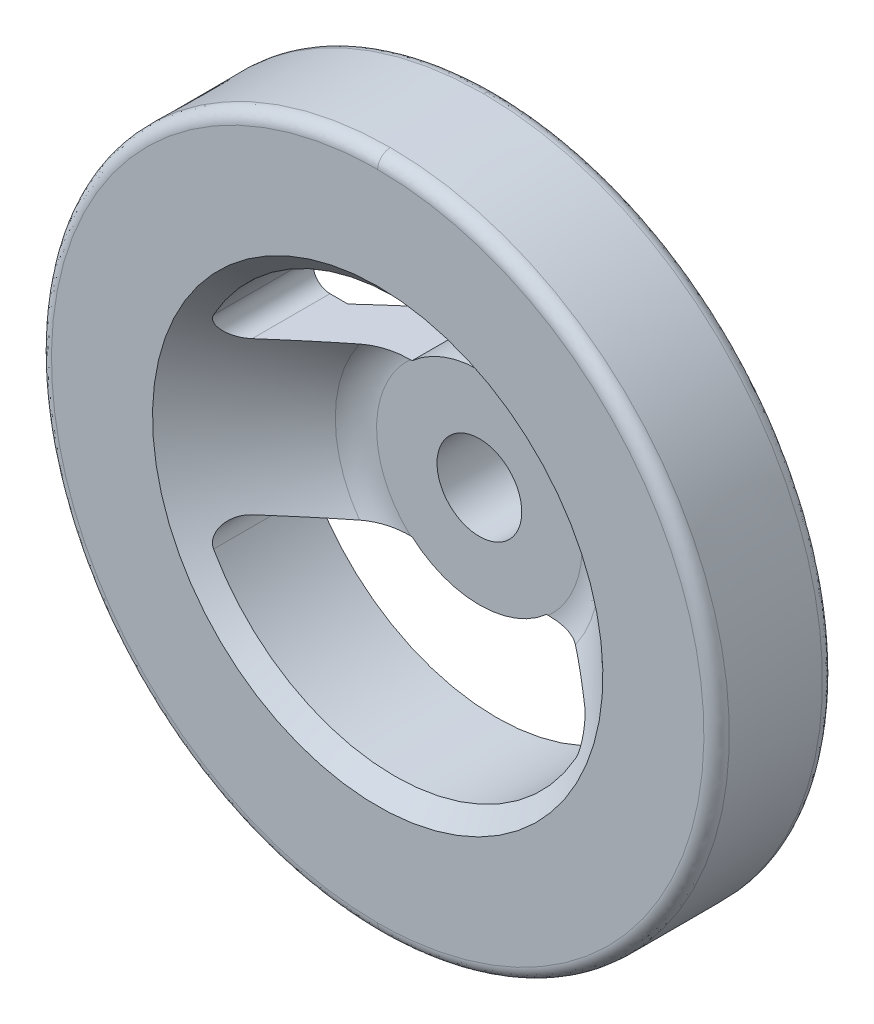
ISO-10303-21;
HEADER;
FILE_DESCRIPTION(('STEP AP214'),'2;1');
FILE_NAME('part.step','',(''),(''),'','','');
FILE_SCHEMA(('AUTOMOTIVE_DESIGN { 1 0 10303 214 1 1 1 1 }'));
ENDSEC;
DATA;
#1=APPLICATION_CONTEXT('core data for automotive mechanical design processes');
#2=APPLICATION_PROTOCOL_DEFINITION('international standard','automotive_design',2000,#1);
#3=PRODUCT_CONTEXT('',#1,'mechanical');
#4=PRODUCT('Part','Part','',(#3));
#5=PRODUCT_RELATED_PRODUCT_CATEGORY('part','',(#4));
#6=PRODUCT_DEFINITION_FORMATION('','',#4);
#7=PRODUCT_DEFINITION_CONTEXT('part definition',#1,'design');
#8=PRODUCT_DEFINITION('design','',#6,#7);
#9=PRODUCT_DEFINITION_SHAPE('','',#8);
#10=(LENGTH_UNIT() NAMED_UNIT(*) SI_UNIT(.MILLI.,.METRE.));
#11=(NAMED_UNIT(*) PLANE_ANGLE_UNIT() SI_UNIT($,.RADIAN.));
#12=(NAMED_UNIT(*) SI_UNIT($,.STERADIAN.) SOLID_ANGLE_UNIT());
#13=UNCERTAINTY_MEASURE_WITH_UNIT(LENGTH_MEASURE(1.E-05),#10,'distance_accuracy_value','');
#14=(GEOMETRIC_REPRESENTATION_CONTEXT(3) GLOBAL_UNCERTAINTY_ASSIGNED_CONTEXT((#13)) GLOBAL_UNIT_ASSIGNED_CONTEXT((#10,
#11,#12)) REPRESENTATION_CONTEXT('',''));
#15=CARTESIAN_POINT('',(0.,0.,0.));
#16=DIRECTION('',(0.,0.,1.));
#17=DIRECTION('',(1.,0.,0.));
#18=AXIS2_PLACEMENT_3D('',#15,#16,#17);
#19=CARTESIAN_POINT('',(0.,0.,0.));
#20=DIRECTION('',(0.,0.,1.));
#21=DIRECTION('',(0.,1.,0.));
#22=AXIS2_PLACEMENT_3D('',#19,#20,#21);
#23=CYLINDRICAL_SURFACE('',#22,5.);
#24=CARTESIAN_POINT('',(0.,0.,16.));
#25=DIRECTION('',(0.,0.,1.));
#26=DIRECTION('',(0.,1.,0.));
#27=AXIS2_PLACEMENT_3D('',#24,#25,#26);
#28=CIRCLE('',#27,5.);
#29=CARTESIAN_POINT('',(0.,5.,16.));
#30=VERTEX_POINT('',#29);
#31=EDGE_CURVE('E371',#30,#30,#28,.T.);
#32=ORIENTED_EDGE('',*,*,#31,.T.);
#33=EDGE_LOOP('',(#32));
#34=FACE_BOUND('',#33,.T.);
#35=CARTESIAN_POINT('',(0.,0.,0.));
#36=DIRECTION('',(0.,0.,1.));
#37=DIRECTION('',(0.,1.,0.));
#38=AXIS2_PLACEMENT_3D('',#35,#36,#37);
#39=CIRCLE('',#38,5.);
#40=CARTESIAN_POINT('',(0.,5.,0.));
#41=VERTEX_POINT('',#40);
#42=EDGE_CURVE('E19',#41,#41,#39,.F.);
#43=ORIENTED_EDGE('',*,*,#42,.T.);
#44=EDGE_LOOP('',(#43));
#45=FACE_BOUND('',#44,.T.);
#46=ADVANCED_FACE('F14',(#34,#45),#23,.F.);
#47=CARTESIAN_POINT('',(12.185787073,-12.14399994,0.));
#48=DIRECTION('',(0.,0.,1.));
#49=DIRECTION('',(0.,1.,0.));
#50=AXIS2_PLACEMENT_3D('',#47,#48,#49);
#51=PLANE('',#50);
#52=ORIENTED_EDGE('',*,*,#42,.F.);
#53=EDGE_LOOP('',(#52));
#54=FACE_BOUND('',#53,.T.);
#55=CARTESIAN_POINT('',(0.,0.,0.));
#56=DIRECTION('',(0.,0.,-1.));
#57=DIRECTION('',(0.,-1.,0.));
#58=AXIS2_PLACEMENT_3D('',#55,#56,#57);
#59=CIRCLE('',#58,11.999999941);
#60=CARTESIAN_POINT('',(0.,-11.999999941,0.));
#61=VERTEX_POINT('',#60);
#62=EDGE_CURVE('E848',#61,#61,#59,.F.);
#63=ORIENTED_EDGE('',*,*,#62,.F.);
#64=EDGE_LOOP('',(#63));
#65=FACE_BOUND('',#64,.T.);
#66=ADVANCED_FACE('F389',(#54,#65),#51,.F.);
#67=CARTESIAN_POINT('',(0.,40.002225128,26.497999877));
#68=CARTESIAN_POINT('',(80.0044502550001,40.002225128,26.497999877));
#69=CARTESIAN_POINT('',(80.0044502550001,-40.002225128,26.497999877));
#70=CARTESIAN_POINT('',(0.,-40.002225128,26.497999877));
#71=CARTESIAN_POINT('',(0.,40.003398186,27.377608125));
#72=CARTESIAN_POINT('',(80.006796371,40.003398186,27.377608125));
#73=CARTESIAN_POINT('',(80.006796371,-40.003398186,27.377608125));
#74=CARTESIAN_POINT('',(0.,-40.003398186,27.377608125));
#75=CARTESIAN_POINT('',(0.,39.381835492,28.000000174));
#76=CARTESIAN_POINT('',(78.7636709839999,39.381835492,28.000000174));
#77=CARTESIAN_POINT('',(78.7636709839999,-39.381835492,28.000000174));
#78=CARTESIAN_POINT('',(0.,-39.381835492,28.000000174));
#79=CARTESIAN_POINT('',(0.,38.502226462,28.000000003));
#80=CARTESIAN_POINT('',(77.004452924,38.502226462,28.000000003));
#81=CARTESIAN_POINT('',(77.004452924,-38.502226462,28.000000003));
#82=CARTESIAN_POINT('',(0.,-38.502226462,28.000000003));
#83=(BOUNDED_SURFACE() B_SPLINE_SURFACE(3,3,((#67,#68,#69,#70),(#71,#72,#73,#74),(#75,#76,#77,
#78),(#79,#80,#81,#82)),.UNSPECIFIED.,.F.,.F.,.F.) B_SPLINE_SURFACE_WITH_KNOTS((4,4),(4,4),(0.,
1.),(0.,1.),.UNSPECIFIED.) GEOMETRIC_REPRESENTATION_ITEM() RATIONAL_B_SPLINE_SURFACE(((1.,
0.333333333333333,0.333333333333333,1.),(0.804423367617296,0.268141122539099,0.268141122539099,
0.804423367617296),(0.804423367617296,0.268141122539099,0.268141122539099,0.804423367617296),
(1.,0.333333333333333,0.333333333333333,1.))) REPRESENTATION_ITEM('') SURFACE());
#84=CARTESIAN_POINT('',(0.,-40.002225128,26.497999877));
#85=CARTESIAN_POINT('',(0.,-40.003398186,27.377608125));
#86=CARTESIAN_POINT('',(0.,-39.381835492,28.000000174));
#87=CARTESIAN_POINT('',(0.,-38.502226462,28.000000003));
#88=(BOUNDED_CURVE() B_SPLINE_CURVE(3,(#84,#85,#86,#87),.UNSPECIFIED.,.F.,
.F.) B_SPLINE_CURVE_WITH_KNOTS((4,4),(0.,1.),
.UNSPECIFIED.) CURVE() GEOMETRIC_REPRESENTATION_ITEM() RATIONAL_B_SPLINE_CURVE((1.,
0.804423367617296,0.804423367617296,1.)) REPRESENTATION_ITEM(''));
#89=CARTESIAN_POINT('',(1.23068902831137E-08,-40.002225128,26.497999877));
#90=VERTEX_POINT('',#89);
#91=CARTESIAN_POINT('',(0.,-38.5022264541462,28.000000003));
#92=VERTEX_POINT('',#91);
#93=EDGE_CURVE('E305',#90,#92,#88,.T.);
#94=CARTESIAN_POINT('',(0.,0.,26.497999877));
#95=DIRECTION('',(0.,0.,1.));
#96=DIRECTION('',(0.,1.,0.));
#97=AXIS2_PLACEMENT_3D('',#94,#95,#96);
#98=CIRCLE('',#97,40.002225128);
#99=CARTESIAN_POINT('',(0.,40.002225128,26.497999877));
#100=VERTEX_POINT('',#99);
#101=EDGE_CURVE('E361',#100,#90,#98,.F.);
#102=CARTESIAN_POINT('',(0.,40.002225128,26.497999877));
#103=CARTESIAN_POINT('',(0.,40.003398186,27.377608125));
#104=CARTESIAN_POINT('',(0.,39.381835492,28.000000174));
#105=CARTESIAN_POINT('',(0.,38.502226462,28.000000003));
#106=(BOUNDED_CURVE() B_SPLINE_CURVE(3,(#102,#103,#104,#105),.UNSPECIFIED.,.F.,
.F.) B_SPLINE_CURVE_WITH_KNOTS((4,4),(0.,1.),
.UNSPECIFIED.) CURVE() GEOMETRIC_REPRESENTATION_ITEM() RATIONAL_B_SPLINE_CURVE((1.,
0.804423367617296,0.804423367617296,1.)) REPRESENTATION_ITEM(''));
#107=CARTESIAN_POINT('',(0.,38.5022264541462,28.000000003));
#108=VERTEX_POINT('',#107);
#109=EDGE_CURVE('E825',#108,#100,#106,.F.);
#110=CARTESIAN_POINT('',(0.,38.5022264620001,28.000000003));
#111=CARTESIAN_POINT('',(77.0044529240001,38.502226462,28.000000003));
#112=CARTESIAN_POINT('',(77.0044529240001,-38.502226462,28.000000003));
#113=CARTESIAN_POINT('',(0.,-38.5022264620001,28.000000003));
#114=(BOUNDED_CURVE() B_SPLINE_CURVE(3,(#110,#111,#112,#113),.UNSPECIFIED.,.F.,
.F.) B_SPLINE_CURVE_WITH_KNOTS((4,4),(0.,1.),
.UNSPECIFIED.) CURVE() GEOMETRIC_REPRESENTATION_ITEM() RATIONAL_B_SPLINE_CURVE((0.99999999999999,
0.33333333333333,0.33333333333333,0.99999999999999)) REPRESENTATION_ITEM(''));
#115=EDGE_CURVE('E403',#108,#92,#114,.T.);
#116=ORIENTED_EDGE('',*,*,#93,.F.);
#117=ORIENTED_EDGE('',*,*,#101,.F.);
#118=ORIENTED_EDGE('',*,*,#109,.F.);
#119=ORIENTED_EDGE('',*,*,#115,.T.);
#120=EDGE_LOOP('',(#116,#117,#118,#119));
#121=FACE_BOUND('',#120,.T.);
#122=ADVANCED_FACE('F320',(#121),#83,.T.);
#123=CARTESIAN_POINT('',(0.,-40.002225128,26.497999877));
#124=CARTESIAN_POINT('',(-80.0044502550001,-40.002225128,26.497999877));
#125=CARTESIAN_POINT('',(-80.0044502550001,40.002225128,26.497999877));
#126=CARTESIAN_POINT('',(0.,40.002225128,26.497999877));
#127=CARTESIAN_POINT('',(0.,-40.003398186,27.377608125));
#128=CARTESIAN_POINT('',(-80.006796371,-40.003398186,27.377608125));
#129=CARTESIAN_POINT('',(-80.006796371,40.003398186,27.377608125));
#130=CARTESIAN_POINT('',(0.,40.003398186,27.377608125));
#131=CARTESIAN_POINT('',(0.,-39.381835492,28.000000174));
#132=CARTESIAN_POINT('',(-78.7636709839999,-39.381835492,28.000000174));
#133=CARTESIAN_POINT('',(-78.7636709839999,39.381835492,28.000000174));
#134=CARTESIAN_POINT('',(0.,39.381835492,28.000000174));
#135=CARTESIAN_POINT('',(0.,-38.502226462,28.000000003));
#136=CARTESIAN_POINT('',(-77.004452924,-38.502226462,28.000000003));
#137=CARTESIAN_POINT('',(-77.004452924,38.502226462,28.000000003));
#138=CARTESIAN_POINT('',(0.,38.502226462,28.000000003));
#139=(BOUNDED_SURFACE() B_SPLINE_SURFACE(3,3,((#123,#124,#125,#126),(#127,#128,#129,#130),(#131,
#132,#133,#134),(#135,#136,#137,#138)),.UNSPECIFIED.,.F.,.F.,
.F.) B_SPLINE_SURFACE_WITH_KNOTS((4,4),(4,4),(0.,1.),(0.,1.),
.UNSPECIFIED.) GEOMETRIC_REPRESENTATION_ITEM() RATIONAL_B_SPLINE_SURFACE(((1.,0.333333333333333,
0.333333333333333,1.),(0.804423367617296,0.268141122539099,0.268141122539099,0.804423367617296),
(0.804423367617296,0.268141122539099,0.268141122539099,0.804423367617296),(1.,0.333333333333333,
0.333333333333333,1.))) REPRESENTATION_ITEM('') SURFACE());
#140=CARTESIAN_POINT('',(0.,0.,26.497999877));
#141=DIRECTION('',(0.,0.,1.));
#142=DIRECTION('',(0.,1.,0.));
#143=AXIS2_PLACEMENT_3D('',#140,#141,#142);
#144=CIRCLE('',#143,40.002225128);
#145=EDGE_CURVE('E368',#90,#100,#144,.F.);
#146=CARTESIAN_POINT('',(0.,-38.5022264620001,28.000000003));
#147=CARTESIAN_POINT('',(-77.0044529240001,-38.502226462,28.000000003));
#148=CARTESIAN_POINT('',(-77.0044529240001,38.502226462,28.000000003));
#149=CARTESIAN_POINT('',(0.,38.5022264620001,28.000000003));
#150=(BOUNDED_CURVE() B_SPLINE_CURVE(3,(#146,#147,#148,#149),.UNSPECIFIED.,.F.,
.F.) B_SPLINE_CURVE_WITH_KNOTS((4,4),(0.,1.),
.UNSPECIFIED.) CURVE() GEOMETRIC_REPRESENTATION_ITEM() RATIONAL_B_SPLINE_CURVE((0.99999999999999,
0.33333333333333,0.33333333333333,0.99999999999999)) REPRESENTATION_ITEM(''));
#151=EDGE_CURVE('E300',#92,#108,#150,.T.);
#152=ORIENTED_EDGE('',*,*,#145,.F.);
#153=ORIENTED_EDGE('',*,*,#93,.T.);
#154=ORIENTED_EDGE('',*,*,#151,.T.);
#155=ORIENTED_EDGE('',*,*,#109,.T.);
#156=EDGE_LOOP('',(#152,#153,#154,#155));
#157=FACE_BOUND('',#156,.T.);
#158=ADVANCED_FACE('F307',(#157),#139,.T.);
#159=CARTESIAN_POINT('',(0.,0.,15.499925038));
#160=DIRECTION('',(0.,0.,1.));
#161=DIRECTION('',(0.,1.,0.));
#162=AXIS2_PLACEMENT_3D('',#159,#160,#161);
#163=CONICAL_SURFACE('',#162,40.001675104,5.00109344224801E-05);
#164=ORIENTED_EDGE('',*,*,#101,.T.);
#165=ORIENTED_EDGE('',*,*,#145,.T.);
#166=EDGE_LOOP('',(#164,#165));
#167=FACE_BOUND('',#166,.T.);
#168=CARTESIAN_POINT('',(0.,0.,15.499925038));
#169=DIRECTION('',(0.,0.,-1.));
#170=DIRECTION('',(0.,-1.,0.));
#171=AXIS2_PLACEMENT_3D('',#168,#169,#170);
#172=CIRCLE('',#171,40.001675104);
#173=CARTESIAN_POINT('',(4.10224035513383E-09,-40.001675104,15.499925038));
#174=VERTEX_POINT('',#173);
#175=CARTESIAN_POINT('',(0.,40.001675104,15.499925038));
#176=VERTEX_POINT('',#175);
#177=EDGE_CURVE('E869',#174,#176,#172,.T.);
#178=ORIENTED_EDGE('',*,*,#177,.F.);
#179=CARTESIAN_POINT('',(0.,0.,15.499925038));
#180=DIRECTION('',(0.,0.,-1.));
#181=DIRECTION('',(0.,-1.,0.));
#182=AXIS2_PLACEMENT_3D('',#179,#180,#181);
#183=CIRCLE('',#182,40.001675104);
#184=EDGE_CURVE('E867',#176,#174,#183,.T.);
#185=ORIENTED_EDGE('',*,*,#184,.F.);
#186=EDGE_LOOP('',(#178,#185));
#187=FACE_BOUND('',#186,.T.);
#188=ADVANCED_FACE('F319',(#167,#187),#163,.T.);
#189=CARTESIAN_POINT('',(12.326043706,12.144,16.));
#190=DIRECTION('',(0.,0.,-1.));
#191=DIRECTION('',(0.,-1.,0.));
#192=AXIS2_PLACEMENT_3D('',#189,#190,#191);
#193=PLANE('',#192);
#194=ORIENTED_EDGE('',*,*,#31,.F.);
#195=EDGE_LOOP('',(#194));
#196=FACE_BOUND('',#195,.T.);
#197=DIRECTION('',(-1.,0.,0.));
#198=VECTOR('',#197,1.);
#199=CARTESIAN_POINT('',(13.7825201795,9.,15.9999999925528));
#200=LINE('',#199,#198);
#201=CARTESIAN_POINT('',(8.13234246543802,9.00000000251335,15.9999999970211));
#202=VERTEX_POINT('',#201);
#203=CARTESIAN_POINT('',(7.93725388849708,9.,15.9999999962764));
#204=VERTEX_POINT('',#203);
#205=EDGE_CURVE('E568',#202,#204,#200,.T.);
#206=ORIENTED_EDGE('',*,*,#205,.T.);
#207=CARTESIAN_POINT('',(0.,0.,16.));
#208=DIRECTION('',(0.,0.,-1.));
#209=DIRECTION('',(0.,-1.,0.));
#210=AXIS2_PLACEMENT_3D('',#207,#208,#209);
#211=CIRCLE('',#210,11.999999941);
#212=CARTESIAN_POINT('',(-7.93725389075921,9.,15.9999999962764));
#213=VERTEX_POINT('',#212);
#214=EDGE_CURVE('E114',#213,#204,#211,.T.);
#215=ORIENTED_EDGE('',*,*,#214,.F.);
#216=DIRECTION('',(-1.,0.,0.));
#217=VECTOR('',#216,1.);
#218=CARTESIAN_POINT('',(-13.782520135,9.,15.9999999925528));
#219=LINE('',#218,#217);
#220=CARTESIAN_POINT('',(-8.13234246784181,9.00000000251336,15.9999999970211));
#221=VERTEX_POINT('',#220);
#222=EDGE_CURVE('E553',#213,#221,#219,.T.);
#223=ORIENTED_EDGE('',*,*,#222,.T.);
#224=CARTESIAN_POINT('',(-8.04164683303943,-9.08112934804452,16.));
#225=CARTESIAN_POINT('',(-13.8876243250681,-3.90431877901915,16.));
#226=CARTESIAN_POINT('',(-13.8876243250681,3.90431877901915,16.));
#227=CARTESIAN_POINT('',(-8.04164683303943,9.08112934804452,16.));
#228=(BOUNDED_CURVE() B_SPLINE_CURVE(3,(#224,#225,#226,#227),.UNSPECIFIED.,.F.,
.F.) B_SPLINE_CURVE_WITH_KNOTS((4,4),(0.,1.),
.UNSPECIFIED.) CURVE() GEOMETRIC_REPRESENTATION_ITEM() RATIONAL_B_SPLINE_CURVE((0.999999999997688,
0.775306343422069,0.775306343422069,0.999999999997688)) REPRESENTATION_ITEM(''));
#229=CARTESIAN_POINT('',(-8.13234246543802,-9.00000000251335,15.9999999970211));
#230=VERTEX_POINT('',#229);
#231=EDGE_CURVE('E121',#221,#230,#228,.F.);
#232=ORIENTED_EDGE('',*,*,#231,.T.);
#233=DIRECTION('',(1.,0.,0.));
#234=VECTOR('',#233,1.);
#235=CARTESIAN_POINT('',(-13.7825201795,-9.,15.9999999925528));
#236=LINE('',#235,#234);
#237=CARTESIAN_POINT('',(-7.93725388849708,-9.,15.9999999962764));
#238=VERTEX_POINT('',#237);
#239=EDGE_CURVE('E493',#230,#238,#236,.T.);
#240=ORIENTED_EDGE('',*,*,#239,.T.);
#241=CARTESIAN_POINT('',(0.,0.,16.));
#242=DIRECTION('',(0.,0.,-1.));
#243=DIRECTION('',(0.,-1.,0.));
#244=AXIS2_PLACEMENT_3D('',#241,#242,#243);
#245=CIRCLE('',#244,11.999999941);
#246=CARTESIAN_POINT('',(7.93725389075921,-9.,15.9999999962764));
#247=VERTEX_POINT('',#246);
#248=EDGE_CURVE('E850',#247,#238,#245,.T.);
#249=ORIENTED_EDGE('',*,*,#248,.F.);
#250=DIRECTION('',(1.,0.,0.));
#251=VECTOR('',#250,1.);
#252=CARTESIAN_POINT('',(13.782520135,-9.,15.9999999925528));
#253=LINE('',#252,#251);
#254=CARTESIAN_POINT('',(8.13234246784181,-9.00000000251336,15.9999999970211));
#255=VERTEX_POINT('',#254);
#256=EDGE_CURVE('E866',#247,#255,#253,.T.);
#257=ORIENTED_EDGE('',*,*,#256,.T.);
#258=CARTESIAN_POINT('',(8.04164683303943,9.08112934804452,16.));
#259=CARTESIAN_POINT('',(13.8876243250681,3.90431877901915,16.));
#260=CARTESIAN_POINT('',(13.8876243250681,-3.90431877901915,16.));
#261=CARTESIAN_POINT('',(8.04164683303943,-9.08112934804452,16.));
#262=(BOUNDED_CURVE() B_SPLINE_CURVE(3,(#258,#259,#260,#261),.UNSPECIFIED.,.F.,
.F.) B_SPLINE_CURVE_WITH_KNOTS((4,4),(0.,1.),
.UNSPECIFIED.) CURVE() GEOMETRIC_REPRESENTATION_ITEM() RATIONAL_B_SPLINE_CURVE((0.999999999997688,
0.775306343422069,0.775306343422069,0.999999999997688)) REPRESENTATION_ITEM(''));
#263=EDGE_CURVE('E863',#255,#202,#262,.F.);
#264=ORIENTED_EDGE('',*,*,#263,.T.);
#265=EDGE_LOOP('',(#206,#215,#223,#232,#240,#249,#257,#264));
#266=FACE_BOUND('',#265,.T.);
#267=ADVANCED_FACE('F331',(#196,#266),#193,.F.);
#268=CARTESIAN_POINT('',(8.041646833,9.081129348,16.));
#269=CARTESIAN_POINT('',(13.887624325,3.904318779,16.));
#270=CARTESIAN_POINT('',(13.887624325,-3.904318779,16.));
#271=CARTESIAN_POINT('',(8.041646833,-9.081129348,16.));
#272=CARTESIAN_POINT('',(8.91171345,10.063662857,16.));
#273=CARTESIAN_POINT('',(15.39019694,4.326746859,16.));
#274=CARTESIAN_POINT('',(15.39019694,-4.326746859,16.));
#275=CARTESIAN_POINT('',(8.91171345,-10.063662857,16.));
#276=CARTESIAN_POINT('',(9.718425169,10.974652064,16.491632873));
#277=CARTESIAN_POINT('',(16.783358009,4.718415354,16.491632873));
#278=CARTESIAN_POINT('',(16.783358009,-4.718415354,16.491632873));
#279=CARTESIAN_POINT('',(9.718425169,-10.974652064,16.491632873));
#280=CARTESIAN_POINT('',(10.344298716,11.681427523,17.403300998));
#281=CARTESIAN_POINT('',(17.864218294,5.022284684,17.403300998));
#282=CARTESIAN_POINT('',(17.864218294,-5.022284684,17.403300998));
#283=CARTESIAN_POINT('',(10.344298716,-11.681427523,17.403300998));
#284=(BOUNDED_SURFACE() B_SPLINE_SURFACE(3,3,((#268,#269,#270,#271),(#272,#273,#274,#275),(#276,
#277,#278,#279),(#280,#281,#282,#283)),.UNSPECIFIED.,.F.,.F.,
.F.) B_SPLINE_SURFACE_WITH_KNOTS((4,4),(4,4),(0.,1.),(0.,1.),
.UNSPECIFIED.) GEOMETRIC_REPRESENTATION_ITEM() RATIONAL_B_SPLINE_SURFACE(((1.,0.775306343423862,
0.775306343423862,1.),(0.951455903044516,0.737669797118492,0.737669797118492,0.951455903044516),
(0.951455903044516,0.737669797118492,0.737669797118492,0.951455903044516),(1.,0.775306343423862,
0.775306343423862,1.))) REPRESENTATION_ITEM('') SURFACE());
#285=CARTESIAN_POINT('',(12.7459901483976,9.,17.403300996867));
#286=CARTESIAN_POINT('',(12.5914108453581,9.,17.2813199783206));
#287=CARTESIAN_POINT('',(12.4303082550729,9.,17.167858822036));
#288=CARTESIAN_POINT('',(12.0979932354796,9.,16.9581611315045));
#289=CARTESIAN_POINT('',(11.9268168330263,9.,16.861867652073));
#290=CARTESIAN_POINT('',(11.5832870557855,9.,16.68941869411));
#291=CARTESIAN_POINT('',(11.4112598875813,9.,16.6126074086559));
#292=CARTESIAN_POINT('',(11.0612936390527,9.,16.4737052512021));
#293=CARTESIAN_POINT('',(10.8833517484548,9.,16.411621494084));
#294=CARTESIAN_POINT('',(10.5224608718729,9.,16.3013122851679));
#295=CARTESIAN_POINT('',(10.3394944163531,9.,16.2531444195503));
#296=CARTESIAN_POINT('',(9.97054227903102,9.,16.1701444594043));
#297=CARTESIAN_POINT('',(9.78455584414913,9.,16.1353157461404));
#298=CARTESIAN_POINT('',(9.35442624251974,9.,16.0694426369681));
#299=CARTESIAN_POINT('',(9.10963157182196,9.,16.0426942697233));
#300=CARTESIAN_POINT('',(8.62058950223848,9.,16.0080320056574));
#301=CARTESIAN_POINT('',(8.37635255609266,9.,15.9999737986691));
#302=CARTESIAN_POINT('',(8.13234246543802,9.,16.));
#303=B_SPLINE_CURVE_WITH_KNOTS('',3,(#285,#286,#287,#288,#289,#290,#291,#292,#293,#294,#295,
#296,#297,#298,#299,#300,#301,#302),.UNSPECIFIED.,.F.,.F.,(4,2,2,2,2,2,2,2,4),(0.,
0.590219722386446,1.17844370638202,1.74293208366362,2.30769261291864,2.87475779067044,
3.44196661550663,4.17993813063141,4.91219238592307),.UNSPECIFIED.);
#304=CARTESIAN_POINT('',(12.7459901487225,9.,17.4033009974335));
#305=VERTEX_POINT('',#304);
#306=EDGE_CURVE('E619',#305,#202,#303,.T.);
#307=CARTESIAN_POINT('',(8.13234246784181,-9.,16.));
#308=CARTESIAN_POINT('',(8.38012953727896,-9.,15.9999731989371));
#309=CARTESIAN_POINT('',(8.62814690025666,-9.,16.0082829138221));
#310=CARTESIAN_POINT('',(9.12350937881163,-9.,16.0439762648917));
#311=CARTESIAN_POINT('',(9.3708503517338,-9.,16.0714161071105));
#312=CARTESIAN_POINT('',(9.8252726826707,-9.,16.1420520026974));
#313=CARTESIAN_POINT('',(10.0328117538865,-9.,16.1822559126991));
#314=CARTESIAN_POINT('',(10.4436058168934,-9.,16.2794177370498));
#315=CARTESIAN_POINT('',(10.646867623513,-9.,16.3363464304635));
#316=CARTESIAN_POINT('',(11.017115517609,-9.,16.4581119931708));
#317=CARTESIAN_POINT('',(11.1849262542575,-9.,16.5204383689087));
#318=CARTESIAN_POINT('',(11.5149432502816,-9.,16.6585270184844));
#319=CARTESIAN_POINT('',(11.6771499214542,-9.,16.7342883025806));
#320=CARTESIAN_POINT('',(11.9959303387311,-9.,16.900448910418));
#321=CARTESIAN_POINT('',(12.1524345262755,-9.,16.9909825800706));
#322=CARTESIAN_POINT('',(12.4564679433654,-9.,17.1863754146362));
#323=CARTESIAN_POINT('',(12.6039864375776,-9.,17.2912512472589));
#324=CARTESIAN_POINT('',(12.7459901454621,-9.,17.4033009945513));
#325=B_SPLINE_CURVE_WITH_KNOTS('',3,(#307,#308,#309,#310,#311,#312,#313,#314,#315,#316,#317,
#318,#319,#320,#321,#322,#323,#324),.UNSPECIFIED.,.F.,.F.,(4,2,2,2,2,2,2,2,4),(0.,
0.743579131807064,1.48935222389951,2.12290775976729,2.7553628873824,3.29185625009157,
3.82831010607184,4.36994660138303,4.91221799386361),.UNSPECIFIED.);
#326=CARTESIAN_POINT('',(12.7459901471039,-9.,17.4033009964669));
#327=VERTEX_POINT('',#326);
#328=EDGE_CURVE('E594',#255,#327,#325,.T.);
#329=CARTESIAN_POINT('',(0.,0.,17.403300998));
#330=DIRECTION('',(0.,0.,1.));
#331=DIRECTION('',(0.,1.,0.));
#332=AXIS2_PLACEMENT_3D('',#329,#330,#331);
#333=CIRCLE('',#332,15.603213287);
#334=EDGE_CURVE('E591',#327,#305,#333,.T.);
#335=ORIENTED_EDGE('',*,*,#306,.T.);
#336=ORIENTED_EDGE('',*,*,#263,.F.);
#337=ORIENTED_EDGE('',*,*,#328,.T.);
#338=ORIENTED_EDGE('',*,*,#334,.T.);
#339=EDGE_LOOP('',(#335,#336,#337,#338));
#340=FACE_BOUND('',#339,.T.);
#341=ADVANCED_FACE('F333',(#340),#284,.F.);
#342=CARTESIAN_POINT('',(0.,0.,16.));
#343=DIRECTION('',(0.,0.,-1.));
#344=DIRECTION('',(0.,-1.,0.));
#345=AXIS2_PLACEMENT_3D('',#342,#343,#344);
#346=CYLINDRICAL_SURFACE('',#345,11.999999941);
#347=DIRECTION('',(0.,0.,1.));
#348=VECTOR('',#347,1.);
#349=CARTESIAN_POINT('',(-7.93725393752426,9.,14.6365570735));
#350=LINE('',#349,#348);
#351=CARTESIAN_POINT('',(-7.93725389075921,9.,6.08571442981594));
#352=VERTEX_POINT('',#351);
#353=EDGE_CURVE('E546',#352,#213,#350,.T.);
#354=ORIENTED_EDGE('',*,*,#353,.T.);
#355=ORIENTED_EDGE('',*,*,#214,.T.);
#356=DIRECTION('',(0.,0.,-1.));
#357=VECTOR('',#356,1.);
#358=CARTESIAN_POINT('',(7.937253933,9.,14.6365570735));
#359=LINE('',#358,#357);
#360=CARTESIAN_POINT('',(7.93725388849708,9.,6.08571442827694));
#361=VERTEX_POINT('',#360);
#362=EDGE_CURVE('E565',#204,#361,#359,.T.);
#363=ORIENTED_EDGE('',*,*,#362,.T.);
#364=CARTESIAN_POINT('',(0.,0.,6.08571439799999));
#365=DIRECTION('',(0.,0.,1.));
#366=DIRECTION('',(0.,1.,0.));
#367=AXIS2_PLACEMENT_3D('',#364,#365,#366);
#368=CIRCLE('',#367,11.999999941);
#369=CARTESIAN_POINT('',(7.93725389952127,-9.,6.0857144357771));
#370=VERTEX_POINT('',#369);
#371=EDGE_CURVE('E620',#370,#361,#368,.T.);
#372=ORIENTED_EDGE('',*,*,#371,.F.);
#373=DIRECTION('',(0.,0.,1.));
#374=VECTOR('',#373,1.);
#375=CARTESIAN_POINT('',(7.93725393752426,-9.,14.6365570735));
#376=LINE('',#375,#374);
#377=EDGE_CURVE('E587',#370,#247,#376,.T.);
#378=ORIENTED_EDGE('',*,*,#377,.T.);
#379=ORIENTED_EDGE('',*,*,#248,.T.);
#380=DIRECTION('',(0.,0.,-1.));
#381=VECTOR('',#380,1.);
#382=CARTESIAN_POINT('',(-7.937253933,-9.,14.6365570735));
#383=LINE('',#382,#381);
#384=CARTESIAN_POINT('',(-7.93725388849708,-9.,6.08571442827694));
#385=VERTEX_POINT('',#384);
#386=EDGE_CURVE('E184',#238,#385,#383,.T.);
#387=ORIENTED_EDGE('',*,*,#386,.T.);
#388=CARTESIAN_POINT('',(0.,0.,6.08571439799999));
#389=DIRECTION('',(0.,0.,1.));
#390=DIRECTION('',(0.,1.,0.));
#391=AXIS2_PLACEMENT_3D('',#388,#389,#390);
#392=CIRCLE('',#391,11.999999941);
#393=EDGE_CURVE('E555',#352,#385,#392,.T.);
#394=ORIENTED_EDGE('',*,*,#393,.F.);
#395=EDGE_LOOP('',(#354,#355,#363,#372,#378,#379,#387,#394));
#396=FACE_BOUND('',#395,.T.);
#397=ORIENTED_EDGE('',*,*,#62,.T.);
#398=EDGE_LOOP('',(#397));
#399=FACE_BOUND('',#398,.T.);
#400=ADVANCED_FACE('F267',(#396,#399),#346,.T.);
#401=CARTESIAN_POINT('',(39.098327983,38.964253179,28.000000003));
#402=DIRECTION('',(0.,0.,-1.));
#403=DIRECTION('',(0.,-1.,0.));
#404=AXIS2_PLACEMENT_3D('',#401,#402,#403);
#405=PLANE('',#404);
#406=CARTESIAN_POINT('',(0.,0.,28.000000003));
#407=DIRECTION('',(0.,0.,1.));
#408=DIRECTION('',(0.,1.,0.));
#409=AXIS2_PLACEMENT_3D('',#406,#407,#408);
#410=CIRCLE('',#409,26.576416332);
#411=CARTESIAN_POINT('',(0.,26.576416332,28.000000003));
#412=VERTEX_POINT('',#411);
#413=EDGE_CURVE('E490',#412,#412,#410,.F.);
#414=ORIENTED_EDGE('',*,*,#413,.T.);
#415=EDGE_LOOP('',(#414));
#416=FACE_BOUND('',#415,.T.);
#417=ORIENTED_EDGE('',*,*,#115,.F.);
#418=ORIENTED_EDGE('',*,*,#151,.F.);
#419=EDGE_LOOP('',(#417,#418));
#420=FACE_BOUND('',#419,.T.);
#421=ADVANCED_FACE('F266',(#416,#420),#405,.F.);
#422=CARTESIAN_POINT('',(-8.041646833,-9.081129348,16.));
#423=CARTESIAN_POINT('',(-13.887624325,-3.904318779,16.));
#424=CARTESIAN_POINT('',(-13.887624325,3.904318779,16.));
#425=CARTESIAN_POINT('',(-8.041646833,9.081129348,16.));
#426=CARTESIAN_POINT('',(-8.91171345,-10.063662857,16.));
#427=CARTESIAN_POINT('',(-15.39019694,-4.326746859,16.));
#428=CARTESIAN_POINT('',(-15.39019694,4.326746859,16.));
#429=CARTESIAN_POINT('',(-8.91171345,10.063662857,16.));
#430=CARTESIAN_POINT('',(-9.718425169,-10.974652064,16.491632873));
#431=CARTESIAN_POINT('',(-16.783358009,-4.718415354,16.491632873));
#432=CARTESIAN_POINT('',(-16.783358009,4.718415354,16.491632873));
#433=CARTESIAN_POINT('',(-9.718425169,10.974652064,16.491632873));
#434=CARTESIAN_POINT('',(-10.344298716,-11.681427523,17.403300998));
#435=CARTESIAN_POINT('',(-17.864218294,-5.022284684,17.403300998));
#436=CARTESIAN_POINT('',(-17.864218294,5.022284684,17.403300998));
#437=CARTESIAN_POINT('',(-10.344298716,11.681427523,17.403300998));
#438=(BOUNDED_SURFACE() B_SPLINE_SURFACE(3,3,((#422,#423,#424,#425),(#426,#427,#428,#429),(#430,
#431,#432,#433),(#434,#435,#436,#437)),.UNSPECIFIED.,.F.,.F.,
.F.) B_SPLINE_SURFACE_WITH_KNOTS((4,4),(4,4),(0.,1.),(0.,1.),
.UNSPECIFIED.) GEOMETRIC_REPRESENTATION_ITEM() RATIONAL_B_SPLINE_SURFACE(((1.,0.775306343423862,
0.775306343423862,1.),(0.951455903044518,0.737669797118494,0.737669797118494,0.951455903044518),
(0.951455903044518,0.737669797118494,0.737669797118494,0.951455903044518),(1.,0.775306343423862,
0.775306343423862,1.))) REPRESENTATION_ITEM('') SURFACE());
#439=CARTESIAN_POINT('',(-8.13234246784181,9.,16.));
#440=CARTESIAN_POINT('',(-8.38012953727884,9.,15.9999731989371));
#441=CARTESIAN_POINT('',(-8.62814690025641,9.,16.0082829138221));
#442=CARTESIAN_POINT('',(-9.12350937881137,9.,16.0439762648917));
#443=CARTESIAN_POINT('',(-9.37085035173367,9.,16.0714161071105));
#444=CARTESIAN_POINT('',(-9.8252726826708,9.,16.1420520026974));
#445=CARTESIAN_POINT('',(-10.0328117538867,9.,16.1822559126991));
#446=CARTESIAN_POINT('',(-10.4436058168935,9.,16.2794177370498));
#447=CARTESIAN_POINT('',(-10.646867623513,9.,16.3363464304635));
#448=CARTESIAN_POINT('',(-11.0171155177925,9.,16.4581119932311));
#449=CARTESIAN_POINT('',(-11.18492625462,9.,16.5204383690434));
#450=CARTESIAN_POINT('',(-11.5149432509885,9.,16.6585270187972));
#451=CARTESIAN_POINT('',(-11.6771499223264,9.,16.7342883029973));
#452=CARTESIAN_POINT('',(-11.9959303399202,9.,16.9004489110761));
#453=CARTESIAN_POINT('',(-12.152434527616,9.,16.990982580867));
#454=CARTESIAN_POINT('',(-12.456467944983,9.,17.1863754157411));
#455=CARTESIAN_POINT('',(-12.6039864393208,9.,17.2912512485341));
#456=CARTESIAN_POINT('',(-12.7459901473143,9.,17.4033009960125));
#457=B_SPLINE_CURVE_WITH_KNOTS('',3,(#439,#440,#441,#442,#443,#444,#445,#446,#447,#448,#449,
#450,#451,#452,#453,#454,#455,#456),.UNSPECIFIED.,.F.,.F.,(4,2,2,2,2,2,2,2,4),(0.,
0.74357913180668,1.48935222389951,2.12290775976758,2.75536288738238,3.29185625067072,
3.82831010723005,4.36994660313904,4.91221799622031),.UNSPECIFIED.);
#458=CARTESIAN_POINT('',(-12.7459901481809,9.,17.4033009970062));
#459=VERTEX_POINT('',#458);
#460=EDGE_CURVE('E547',#221,#459,#457,.T.);
#461=CARTESIAN_POINT('',(0.,0.,17.403300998));
#462=DIRECTION('',(0.,0.,1.));
#463=DIRECTION('',(0.,1.,0.));
#464=AXIS2_PLACEMENT_3D('',#461,#462,#463);
#465=CIRCLE('',#464,15.603213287);
#466=CARTESIAN_POINT('',(-12.7459901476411,-9.,17.4033009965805));
#467=VERTEX_POINT('',#466);
#468=EDGE_CURVE('E197',#459,#467,#465,.T.);
#469=CARTESIAN_POINT('',(-12.745990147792,-9.,17.4033009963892));
#470=CARTESIAN_POINT('',(-12.5914108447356,-9.,17.2813199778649));
#471=CARTESIAN_POINT('',(-12.4303082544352,-9.,17.1678588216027));
#472=CARTESIAN_POINT('',(-12.0979932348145,-9.,16.9581611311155));
#473=CARTESIAN_POINT('',(-11.926816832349,-9.,16.8618676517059));
#474=CARTESIAN_POINT('',(-11.5832870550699,-9.,16.6894186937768));
#475=CARTESIAN_POINT('',(-11.4112598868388,-9.,16.6126074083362));
#476=CARTESIAN_POINT('',(-11.0612936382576,-9.,16.4737052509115));
#477=CARTESIAN_POINT('',(-10.883351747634,-9.,16.4116214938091));
#478=CARTESIAN_POINT('',(-10.5224608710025,-9.,16.301312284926));
#479=CARTESIAN_POINT('',(-10.3394944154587,-9.,16.2531444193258));
#480=CARTESIAN_POINT('',(-9.97054227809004,-9.,16.1701444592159));
#481=CARTESIAN_POINT('',(-9.7845558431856,-9.,16.1353157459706));
#482=CARTESIAN_POINT('',(-9.35442624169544,-9.,16.0694426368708));
#483=CARTESIAN_POINT('',(-9.1096315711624,-9.,16.042694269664));
#484=CARTESIAN_POINT('',(-8.62058950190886,-9.,16.0080320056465));
#485=CARTESIAN_POINT('',(-8.3763525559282,-9.,15.9999737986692));
#486=CARTESIAN_POINT('',(-8.13234246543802,-9.,16.));
#487=B_SPLINE_CURVE_WITH_KNOTS('',3,(#469,#470,#471,#472,#473,#474,#475,#476,#477,#478,#479,
#480,#481,#482,#483,#484,#485,#486),.UNSPECIFIED.,.F.,.F.,(4,2,2,2,2,2,2,2,4),(0.,
0.590219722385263,1.17844370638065,1.74293208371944,2.30769261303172,2.87475779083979,
3.44196661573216,4.17993813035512,4.91219238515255),.UNSPECIFIED.);
#488=EDGE_CURVE('E183',#467,#230,#487,.T.);
#489=ORIENTED_EDGE('',*,*,#460,.T.);
#490=ORIENTED_EDGE('',*,*,#468,.T.);
#491=ORIENTED_EDGE('',*,*,#488,.T.);
#492=ORIENTED_EDGE('',*,*,#231,.F.);
#493=EDGE_LOOP('',(#489,#490,#491,#492));
#494=FACE_BOUND('',#493,.T.);
#495=ADVANCED_FACE('F258',(#494),#438,.F.);
#496=CARTESIAN_POINT('',(0.,38.500899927,14.000000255));
#497=CARTESIAN_POINT('',(77.001799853,38.500899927,14.000000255));
#498=CARTESIAN_POINT('',(77.001799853,-38.500899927,14.000000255));
#499=CARTESIAN_POINT('',(0.,-38.500899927,14.000000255));
#500=CARTESIAN_POINT('',(0.,39.379904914,13.999545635));
#501=CARTESIAN_POINT('',(78.759809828,39.379904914,13.999545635));
#502=CARTESIAN_POINT('',(78.759809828,-39.379904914,13.999545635));
#503=CARTESIAN_POINT('',(0.,-39.379904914,13.999545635));
#504=CARTESIAN_POINT('',(0.,40.001631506,14.620919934));
#505=CARTESIAN_POINT('',(80.003263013,40.001631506,14.620919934));
#506=CARTESIAN_POINT('',(80.003263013,-40.001631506,14.620919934));
#507=CARTESIAN_POINT('',(0.,-40.001631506,14.620919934));
#508=CARTESIAN_POINT('',(0.,40.001675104,15.499925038));
#509=CARTESIAN_POINT('',(80.0033502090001,40.001675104,15.499925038));
#510=CARTESIAN_POINT('',(80.0033502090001,-40.001675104,15.499925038));
#511=CARTESIAN_POINT('',(0.,-40.001675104,15.499925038));
#512=(BOUNDED_SURFACE() B_SPLINE_SURFACE(3,3,((#496,#497,#498,#499),(#500,#501,#502,#503),(#504,
#505,#506,#507),(#508,#509,#510,#511)),.UNSPECIFIED.,.F.,.F.,
.F.) B_SPLINE_SURFACE_WITH_KNOTS((4,4),(4,4),(0.,1.),(0.,1.),
.UNSPECIFIED.) GEOMETRIC_REPRESENTATION_ITEM() RATIONAL_B_SPLINE_SURFACE(((1.,0.333333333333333,
0.333333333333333,1.),(0.804627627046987,0.268209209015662,0.268209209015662,0.804627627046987),
(0.804627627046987,0.268209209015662,0.268209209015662,0.804627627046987),(1.,0.333333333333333,
0.333333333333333,1.))) REPRESENTATION_ITEM('') SURFACE());
#513=CARTESIAN_POINT('',(0.,-38.500899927,14.000000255));
#514=CARTESIAN_POINT('',(0.,-39.379904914,13.999545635));
#515=CARTESIAN_POINT('',(0.,-40.001631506,14.620919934));
#516=CARTESIAN_POINT('',(0.,-40.001675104,15.499925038));
#517=(BOUNDED_CURVE() B_SPLINE_CURVE(3,(#513,#514,#515,#516),.UNSPECIFIED.,.F.,
.F.) B_SPLINE_CURVE_WITH_KNOTS((4,4),(0.,1.),
.UNSPECIFIED.) CURVE() GEOMETRIC_REPRESENTATION_ITEM() RATIONAL_B_SPLINE_CURVE((1.,
0.804627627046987,0.804627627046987,1.)) REPRESENTATION_ITEM(''));
#518=CARTESIAN_POINT('',(0.,-38.5008999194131,14.0000002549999));
#519=VERTEX_POINT('',#518);
#520=EDGE_CURVE('E875',#519,#174,#517,.T.);
#521=CARTESIAN_POINT('',(0.,-38.5008999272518,14.0000002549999));
#522=CARTESIAN_POINT('',(77.0017998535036,-38.5008999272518,14.0000002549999));
#523=CARTESIAN_POINT('',(77.0017998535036,38.5008999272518,14.0000002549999));
#524=CARTESIAN_POINT('',(0.,38.5008999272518,14.0000002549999));
#525=(BOUNDED_CURVE() B_SPLINE_CURVE(3,(#521,#522,#523,#524),.UNSPECIFIED.,.F.,
.F.) B_SPLINE_CURVE_WITH_KNOTS((4,4),(0.,1.),
.UNSPECIFIED.) CURVE() GEOMETRIC_REPRESENTATION_ITEM() RATIONAL_B_SPLINE_CURVE((0.999999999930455,
0.333333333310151,0.333333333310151,0.999999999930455)) REPRESENTATION_ITEM(''));
#526=CARTESIAN_POINT('',(0.,38.5008999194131,14.0000002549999));
#527=VERTEX_POINT('',#526);
#528=EDGE_CURVE('E427',#519,#527,#525,.T.);
#529=CARTESIAN_POINT('',(0.,38.500899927,14.000000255));
#530=CARTESIAN_POINT('',(0.,39.379904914,13.999545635));
#531=CARTESIAN_POINT('',(0.,40.001631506,14.620919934));
#532=CARTESIAN_POINT('',(0.,40.001675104,15.499925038));
#533=(BOUNDED_CURVE() B_SPLINE_CURVE(3,(#529,#530,#531,#532),.UNSPECIFIED.,.F.,
.F.) B_SPLINE_CURVE_WITH_KNOTS((4,4),(0.,1.),
.UNSPECIFIED.) CURVE() GEOMETRIC_REPRESENTATION_ITEM() RATIONAL_B_SPLINE_CURVE((1.,
0.804627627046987,0.804627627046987,1.)) REPRESENTATION_ITEM(''));
#534=EDGE_CURVE('E505',#176,#527,#533,.F.);
#535=ORIENTED_EDGE('',*,*,#520,.F.);
#536=ORIENTED_EDGE('',*,*,#528,.T.);
#537=ORIENTED_EDGE('',*,*,#534,.F.);
#538=ORIENTED_EDGE('',*,*,#184,.T.);
#539=EDGE_LOOP('',(#535,#536,#537,#538));
#540=FACE_BOUND('',#539,.T.);
#541=ADVANCED_FACE('F265',(#540),#512,.T.);
#542=CARTESIAN_POINT('',(0.,-38.500899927,14.000000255));
#543=CARTESIAN_POINT('',(-77.001799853,-38.500899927,14.000000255));
#544=CARTESIAN_POINT('',(-77.001799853,38.500899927,14.000000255));
#545=CARTESIAN_POINT('',(0.,38.500899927,14.000000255));
#546=CARTESIAN_POINT('',(0.,-39.379904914,13.999545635));
#547=CARTESIAN_POINT('',(-78.759809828,-39.379904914,13.999545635));
#548=CARTESIAN_POINT('',(-78.759809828,39.379904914,13.999545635));
#549=CARTESIAN_POINT('',(0.,39.379904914,13.999545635));
#550=CARTESIAN_POINT('',(0.,-40.001631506,14.620919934));
#551=CARTESIAN_POINT('',(-80.003263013,-40.001631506,14.620919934));
#552=CARTESIAN_POINT('',(-80.003263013,40.001631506,14.620919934));
#553=CARTESIAN_POINT('',(0.,40.001631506,14.620919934));
#554=CARTESIAN_POINT('',(0.,-40.001675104,15.499925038));
#555=CARTESIAN_POINT('',(-80.0033502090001,-40.001675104,15.499925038));
#556=CARTESIAN_POINT('',(-80.0033502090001,40.001675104,15.499925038));
#557=CARTESIAN_POINT('',(0.,40.001675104,15.499925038));
#558=(BOUNDED_SURFACE() B_SPLINE_SURFACE(3,3,((#542,#543,#544,#545),(#546,#547,#548,#549),(#550,
#551,#552,#553),(#554,#555,#556,#557)),.UNSPECIFIED.,.F.,.F.,
.F.) B_SPLINE_SURFACE_WITH_KNOTS((4,4),(4,4),(0.,1.),(0.,1.),
.UNSPECIFIED.) GEOMETRIC_REPRESENTATION_ITEM() RATIONAL_B_SPLINE_SURFACE(((1.,0.333333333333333,
0.333333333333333,1.),(0.804627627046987,0.268209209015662,0.268209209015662,0.804627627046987),
(0.804627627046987,0.268209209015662,0.268209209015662,0.804627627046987),(1.,0.333333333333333,
0.333333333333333,1.))) REPRESENTATION_ITEM('') SURFACE());
#559=CARTESIAN_POINT('',(0.,38.5008999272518,14.0000002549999));
#560=CARTESIAN_POINT('',(-77.0017998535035,38.5008999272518,14.0000002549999));
#561=CARTESIAN_POINT('',(-77.0017998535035,-38.5008999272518,14.0000002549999));
#562=CARTESIAN_POINT('',(0.,-38.5008999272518,14.0000002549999));
#563=(BOUNDED_CURVE() B_SPLINE_CURVE(3,(#559,#560,#561,#562),.UNSPECIFIED.,.F.,
.F.) B_SPLINE_CURVE_WITH_KNOTS((4,4),(0.,1.),
.UNSPECIFIED.) CURVE() GEOMETRIC_REPRESENTATION_ITEM() RATIONAL_B_SPLINE_CURVE((0.999999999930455,
0.333333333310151,0.333333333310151,0.999999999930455)) REPRESENTATION_ITEM(''));
#564=EDGE_CURVE('E439',#527,#519,#563,.T.);
#565=ORIENTED_EDGE('',*,*,#564,.T.);
#566=ORIENTED_EDGE('',*,*,#520,.T.);
#567=ORIENTED_EDGE('',*,*,#177,.T.);
#568=ORIENTED_EDGE('',*,*,#534,.T.);
#569=EDGE_LOOP('',(#565,#566,#567,#568));
#570=FACE_BOUND('',#569,.T.);
#571=ADVANCED_FACE('F507',(#570),#558,.T.);
#572=CARTESIAN_POINT('',(19.627786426,-9.,23.290009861));
#573=DIRECTION('',(0.,1.,0.));
#574=DIRECTION('',(0.,0.,-1.));
#575=AXIS2_PLACEMENT_3D('',#572,#573,#574);
#576=PLANE('',#575);
#577=CARTESIAN_POINT('',(17.5177379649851,-9.,14.0000000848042));
#578=CARTESIAN_POINT('',(17.1353634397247,-9.,13.6502155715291));
#579=CARTESIAN_POINT('',(16.7518364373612,-9.,13.3016802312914));
#580=CARTESIAN_POINT('',(15.9819431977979,-9.,12.607755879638));
#581=CARTESIAN_POINT('',(15.5955769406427,-9.,12.2623668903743));
#582=CARTESIAN_POINT('',(14.8198955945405,-9.,11.5757593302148));
#583=CARTESIAN_POINT('',(14.4305841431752,-9.,11.2345366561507));
#584=CARTESIAN_POINT('',(13.6478955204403,-9.,10.5567877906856));
#585=CARTESIAN_POINT('',(13.2545183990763,-9.,10.2202615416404));
#586=CARTESIAN_POINT('',(12.4624551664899,-9.,9.55281193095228));
#587=CARTESIAN_POINT('',(12.063764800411,-9.,9.22189361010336));
#588=CARTESIAN_POINT('',(11.2602732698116,-9.,8.56761518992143));
#589=CARTESIAN_POINT('',(10.855472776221,-9.,8.24425427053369));
#590=CARTESIAN_POINT('',(10.2422838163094,-9.,7.76642599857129));
#591=CARTESIAN_POINT('',(10.0367718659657,-9.,7.60826493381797));
#592=CARTESIAN_POINT('',(9.62358333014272,-9.,7.29480328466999));
#593=CARTESIAN_POINT('',(9.41590680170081,-9.,7.13950262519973));
#594=CARTESIAN_POINT('',(8.99804307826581,-9.,6.8321469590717));
#595=CARTESIAN_POINT('',(8.7878549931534,-9.,6.68009315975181));
#596=CARTESIAN_POINT('',(8.36470749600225,-9.,6.37985399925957));
#597=CARTESIAN_POINT('',(8.15174783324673,-9.,6.2316689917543));
#598=CARTESIAN_POINT('',(7.93725386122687,-9.,6.08571440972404));
#599=B_SPLINE_CURVE_WITH_KNOTS('',3,(#577,#578,#579,#580,#581,#582,#583,#584,#585,#586,#587,
#588,#589,#590,#591,#592,#593,#594,#595,#596,#597,#598),.UNSPECIFIED.,.F.,.F.,(4,2,2,2,2,2,2,2,
2,2,4),(0.,1.55468977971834,3.10939049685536,4.66241123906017,6.21541290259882,7.7697434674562,
9.32390458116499,10.1018631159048,10.879801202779,11.6580236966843,12.4363170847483),.UNSPECIFIED.);
#600=CARTESIAN_POINT('',(17.5177380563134,-8.99999996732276,14.000000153));
#601=VERTEX_POINT('',#600);
#602=EDGE_CURVE('E491',#601,#370,#599,.T.);
#603=ORIENTED_EDGE('',*,*,#602,.F.);
#604=DIRECTION('',(1.,0.,0.));
#605=VECTOR('',#604,1.);
#606=CARTESIAN_POINT('',(0.,-8.99999996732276,14.000000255));
#607=LINE('',#606,#605);
#608=CARTESIAN_POINT('',(19.6277864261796,-8.99999998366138,14.000000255));
#609=VERTEX_POINT('',#608);
#610=EDGE_CURVE('E468',#601,#609,#607,.T.);
#611=ORIENTED_EDGE('',*,*,#610,.T.);
#612=DIRECTION('',(0.,0.,1.));
#613=VECTOR('',#612,1.);
#614=CARTESIAN_POINT('',(19.6277864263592,-9.,20.03339864));
#615=LINE('',#614,#613);
#616=CARTESIAN_POINT('',(19.6277864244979,-9.,23.1873997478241));
#617=VERTEX_POINT('',#616);
#618=EDGE_CURVE('E496',#609,#617,#615,.T.);
#619=ORIENTED_EDGE('',*,*,#618,.T.);
#620=CARTESIAN_POINT('',(12.7459901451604,-9.,17.4033009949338));
#621=CARTESIAN_POINT('',(13.04013683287,-9.,17.6353662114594));
#622=CARTESIAN_POINT('',(13.3330051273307,-9.,17.8690424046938));
#623=CARTESIAN_POINT('',(13.9164877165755,-9.,18.3391783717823));
#624=CARTESIAN_POINT('',(14.207102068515,-9.,18.5756380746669));
#625=CARTESIAN_POINT('',(14.7863480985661,-9.,19.0508764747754));
#626=CARTESIAN_POINT('',(15.0749800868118,-9.,19.2896547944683));
#627=CARTESIAN_POINT('',(15.6505533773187,-9.,19.769242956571));
#628=CARTESIAN_POINT('',(15.9374946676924,-9.,20.0100528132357));
#629=CARTESIAN_POINT('',(16.7960589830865,-9.,20.7350624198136));
#630=CARTESIAN_POINT('',(17.3654709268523,-9.,21.2218821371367));
#631=CARTESIAN_POINT('',(18.2161867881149,-9.,21.9561341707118));
#632=CARTESIAN_POINT('',(18.4992152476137,-9.,22.2015759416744));
#633=CARTESIAN_POINT('',(19.0642423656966,-9.,22.6936393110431));
#634=CARTESIAN_POINT('',(19.3462410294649,-9.,22.9402609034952));
#635=CARTESIAN_POINT('',(19.6277864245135,-9.,23.1873997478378));
#636=B_SPLINE_CURVE_WITH_KNOTS('',3,(#620,#621,#622,#623,#624,#625,#626,#627,#628,#629,#630,
#631,#632,#633,#634,#635),.UNSPECIFIED.,.F.,.F.,(4,2,2,2,2,2,2,4),(0.,1.12399159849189,
2.24795460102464,3.37173756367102,4.49552841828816,6.74292173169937,7.86680628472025,
8.9906851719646),.UNSPECIFIED.);
#637=EDGE_CURVE('E589',#327,#617,#636,.T.);
#638=ORIENTED_EDGE('',*,*,#637,.F.);
#639=ORIENTED_EDGE('',*,*,#328,.F.);
#640=ORIENTED_EDGE('',*,*,#256,.F.);
#641=ORIENTED_EDGE('',*,*,#377,.F.);
#642=EDGE_LOOP('',(#603,#611,#619,#638,#639,#640,#641));
#643=FACE_BOUND('',#642,.T.);
#644=ADVANCED_FACE('F227',(#643),#576,.F.);
#645=CARTESIAN_POINT('',(19.627786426,-11.,14.000000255));
#646=DIRECTION('',(0.,0.,1.));
#647=DIRECTION('',(0.,1.,0.));
#648=AXIS2_PLACEMENT_3D('',#645,#646,#647);
#649=CYLINDRICAL_SURFACE('',#648,2.);
#650=CARTESIAN_POINT('',(19.627786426,-11.,14.000000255));
#651=DIRECTION('',(0.,0.,1.));
#652=DIRECTION('',(0.,1.,0.));
#653=AXIS2_PLACEMENT_3D('',#650,#651,#652);
#654=CIRCLE('',#653,2.);
#655=CARTESIAN_POINT('',(21.3724785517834,-11.9777777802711,14.000000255));
#656=VERTEX_POINT('',#655);
#657=EDGE_CURVE('E466',#609,#656,#654,.F.);
#658=ORIENTED_EDGE('',*,*,#657,.T.);
#659=DIRECTION('',(0.,0.,1.));
#660=VECTOR('',#659,1.);
#661=CARTESIAN_POINT('',(21.3724785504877,-11.9777777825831,19.997414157));
#662=LINE('',#661,#660);
#663=CARTESIAN_POINT('',(21.3724785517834,-11.9777777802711,25.994828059));
#664=VERTEX_POINT('',#663);
#665=EDGE_CURVE('E494',#656,#664,#662,.T.);
#666=ORIENTED_EDGE('',*,*,#665,.T.);
#667=CARTESIAN_POINT('',(19.6277864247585,-9.0000000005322,23.1873997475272));
#668=CARTESIAN_POINT('',(19.7053001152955,-9.00002631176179,23.2554588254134));
#669=CARTESIAN_POINT('',(19.7818612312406,-9.00450571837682,23.3245312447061));
#670=CARTESIAN_POINT('',(19.9326537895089,-9.02190999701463,23.4640731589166));
#671=CARTESIAN_POINT('',(20.0068863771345,-9.03483064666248,23.5345419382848));
#672=CARTESIAN_POINT('',(20.1529124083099,-9.06871256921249,23.6765464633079));
#673=CARTESIAN_POINT('',(20.224697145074,-9.08969982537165,23.7480849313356));
#674=CARTESIAN_POINT('',(20.3651722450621,-9.13940469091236,23.8914983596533));
#675=CARTESIAN_POINT('',(20.4338621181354,-9.16812351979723,23.9633733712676));
#676=CARTESIAN_POINT('',(20.6356297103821,-9.26600998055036,24.1798374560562));
#677=CARTESIAN_POINT('',(20.7634497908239,-9.34668303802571,24.3243347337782));
#678=CARTESIAN_POINT('',(21.000495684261,-9.53753987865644,24.6088510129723));
#679=CARTESIAN_POINT('',(21.1097453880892,-9.64768526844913,24.7488755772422));
#680=CARTESIAN_POINT('',(21.2781939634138,-9.86434282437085,24.9841797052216));
#681=CARTESIAN_POINT('',(21.3430032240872,-9.9642192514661,25.0815563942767));
#682=CARTESIAN_POINT('',(21.4557740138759,-10.1795203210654,25.2686293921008));
#683=CARTESIAN_POINT('',(21.5037610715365,-10.2949210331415,25.3583371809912));
#684=CARTESIAN_POINT('',(21.5695489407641,-10.511007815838,25.506382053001));
#685=CARTESIAN_POINT('',(21.5918105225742,-10.6086884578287,25.5671121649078));
#686=CARTESIAN_POINT('',(21.6214803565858,-10.8112528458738,25.6796593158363));
#687=CARTESIAN_POINT('',(21.6289049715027,-10.9161285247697,25.7314861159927));
#688=CARTESIAN_POINT('',(21.6266271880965,-11.1107544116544,25.8148753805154));
#689=CARTESIAN_POINT('',(21.6198558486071,-11.1996858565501,25.8484141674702));
#690=CARTESIAN_POINT('',(21.5936857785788,-11.378659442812,25.9060528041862));
#691=CARTESIAN_POINT('',(21.5743122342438,-11.4686990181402,25.9301713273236));
#692=CARTESIAN_POINT('',(21.5274804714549,-11.6298995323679,25.9638981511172));
#693=CARTESIAN_POINT('',(21.5023261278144,-11.701327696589,25.9754157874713));
#694=CARTESIAN_POINT('',(21.4583217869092,-11.806597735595,25.9870200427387));
#695=CARTESIAN_POINT('',(21.4425638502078,-11.8414551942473,25.9899429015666));
#696=CARTESIAN_POINT('',(21.4090224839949,-11.9103116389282,25.9938485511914));
#697=CARTESIAN_POINT('',(21.3912381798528,-11.9443102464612,25.9948305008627));
#698=CARTESIAN_POINT('',(21.3724785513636,-11.9777777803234,25.9948280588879));
#699=B_SPLINE_CURVE_WITH_KNOTS('',3,(#667,#668,#669,#670,#671,#672,#673,#674,#675,#676,#677,
#678,#679,#680,#681,#682,#683,#684,#685,#686,#687,#688,#689,#690,#691,#692,#693,#694,#695,#696,
#697,#698),.UNSPECIFIED.,.F.,.F.,(4,2,2,2,2,2,2,2,2,2,2,2,2,2,2,4),(0.,0.309283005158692,
0.618411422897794,0.928544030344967,1.23872558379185,1.86310075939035,2.48666649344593,
2.94654904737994,3.40573065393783,3.75596164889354,4.10580618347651,4.39052370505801,
4.67467394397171,4.90358425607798,5.01857971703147,5.13362500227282),.UNSPECIFIED.);
#700=EDGE_CURVE('E251',#617,#664,#699,.T.);
#701=ORIENTED_EDGE('',*,*,#700,.F.);
#702=ORIENTED_EDGE('',*,*,#618,.F.);
#703=EDGE_LOOP('',(#658,#666,#701,#702));
#704=FACE_BOUND('',#703,.T.);
#705=ADVANCED_FACE('F517',(#704),#649,.F.);
#706=CARTESIAN_POINT('',(0.,0.,14.000000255));
#707=DIRECTION('',(0.,0.,1.));
#708=DIRECTION('',(0.,1.,0.));
#709=AXIS2_PLACEMENT_3D('',#706,#707,#708);
#710=CYLINDRICAL_SURFACE('',#709,24.5);
#711=CARTESIAN_POINT('',(0.,0.,14.000000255));
#712=DIRECTION('',(0.,0.,1.));
#713=DIRECTION('',(0.,1.,0.));
#714=AXIS2_PLACEMENT_3D('',#711,#712,#713);
#715=CIRCLE('',#714,24.5);
#716=CARTESIAN_POINT('',(-21.372478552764,-11.9777777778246,14.000000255));
#717=VERTEX_POINT('',#716);
#718=EDGE_CURVE('E465',#656,#717,#715,.F.);
#719=ORIENTED_EDGE('',*,*,#718,.T.);
#720=DIRECTION('',(0.,0.,1.));
#721=VECTOR('',#720,1.);
#722=CARTESIAN_POINT('',(-21.372478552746,-11.9777777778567,20.03339864));
#723=LINE('',#722,#721);
#724=CARTESIAN_POINT('',(-21.3724785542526,-11.9777777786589,25.9948280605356));
#725=VERTEX_POINT('',#724);
#726=EDGE_CURVE('E167',#717,#725,#723,.T.);
#727=ORIENTED_EDGE('',*,*,#726,.T.);
#728=CARTESIAN_POINT('',(0.,0.,25.9948280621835));
#729=DIRECTION('',(0.,0.,1.));
#730=DIRECTION('',(0.,1.,0.));
#731=AXIS2_PLACEMENT_3D('',#728,#729,#730);
#732=CIRCLE('',#731,24.5000000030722);
#733=EDGE_CURVE('E193',#725,#664,#732,.T.);
#734=ORIENTED_EDGE('',*,*,#733,.T.);
#735=ORIENTED_EDGE('',*,*,#665,.F.);
#736=EDGE_LOOP('',(#719,#727,#734,#735));
#737=FACE_BOUND('',#736,.T.);
#738=ADVANCED_FACE('F526',(#737),#710,.F.);
#739=CARTESIAN_POINT('',(-19.627786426,-11.,14.000000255));
#740=DIRECTION('',(0.,0.,1.));
#741=DIRECTION('',(0.,1.,0.));
#742=AXIS2_PLACEMENT_3D('',#739,#740,#741);
#743=CYLINDRICAL_SURFACE('',#742,2.);
#744=CARTESIAN_POINT('',(-19.627786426,-11.,14.000000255));
#745=DIRECTION('',(0.,0.,1.));
#746=DIRECTION('',(0.,1.,0.));
#747=AXIS2_PLACEMENT_3D('',#744,#745,#746);
#748=CIRCLE('',#747,2.);
#749=CARTESIAN_POINT('',(-19.627786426,-8.99999998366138,14.000000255));
#750=VERTEX_POINT('',#749);
#751=EDGE_CURVE('E178',#717,#750,#748,.F.);
#752=ORIENTED_EDGE('',*,*,#751,.T.);
#753=DIRECTION('',(0.,0.,1.));
#754=VECTOR('',#753,1.);
#755=CARTESIAN_POINT('',(-19.627786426,-9.,14.6365570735));
#756=LINE('',#755,#754);
#757=CARTESIAN_POINT('',(-19.6277864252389,-9.,23.1873997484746));
#758=VERTEX_POINT('',#757);
#759=EDGE_CURVE('E173',#750,#758,#756,.T.);
#760=ORIENTED_EDGE('',*,*,#759,.T.);
#761=CARTESIAN_POINT('',(-19.6277864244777,-9.,23.1873997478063));
#762=CARTESIAN_POINT('',(-19.7053001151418,-9.00002631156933,23.2554588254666));
#763=CARTESIAN_POINT('',(-19.7818612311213,-9.00450571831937,23.3245312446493));
#764=CARTESIAN_POINT('',(-19.9326537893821,-9.02190999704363,23.4640731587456));
#765=CARTESIAN_POINT('',(-20.0068863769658,-9.03483064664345,23.5345419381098));
#766=CARTESIAN_POINT('',(-20.1529124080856,-9.06871256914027,23.6765464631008));
#767=CARTESIAN_POINT('',(-20.2246971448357,-9.08969982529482,23.7480849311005));
#768=CARTESIAN_POINT('',(-20.3651722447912,-9.13940469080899,23.8914983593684));
#769=CARTESIAN_POINT('',(-20.4338621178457,-9.1681235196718,23.9633733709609));
#770=CARTESIAN_POINT('',(-20.6356297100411,-9.26600998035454,24.179837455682));
#771=CARTESIAN_POINT('',(-20.7634497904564,-9.34668303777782,24.3243347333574));
#772=CARTESIAN_POINT('',(-21.0004956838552,-9.53753987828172,24.608851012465));
#773=CARTESIAN_POINT('',(-21.1097453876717,-9.64768526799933,24.7488755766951));
#774=CARTESIAN_POINT('',(-21.2781939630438,-9.86434282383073,24.9841797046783));
#775=CARTESIAN_POINT('',(-21.3430032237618,-9.9642192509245,25.0815563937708));
#776=CARTESIAN_POINT('',(-21.4557740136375,-10.1795203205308,25.2686293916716));
#777=CARTESIAN_POINT('',(-21.5037610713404,-10.2949210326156,25.3583371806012));
#778=CARTESIAN_POINT('',(-21.5695489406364,-10.5110078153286,25.5063820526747));
#779=CARTESIAN_POINT('',(-21.5918105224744,-10.6086884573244,25.5671121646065));
#780=CARTESIAN_POINT('',(-21.6214803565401,-10.8112528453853,25.6796593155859));
#781=CARTESIAN_POINT('',(-21.6289049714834,-10.9161285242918,25.7314861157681));
#782=CARTESIAN_POINT('',(-21.6266271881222,-11.1107544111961,25.8148753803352));
#783=CARTESIAN_POINT('',(-21.6198558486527,-11.1996858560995,25.8484141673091));
#784=CARTESIAN_POINT('',(-21.593685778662,-11.3786594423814,25.9060528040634));
#785=CARTESIAN_POINT('',(-21.5743122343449,-11.4686990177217,25.9301713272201));
#786=CARTESIAN_POINT('',(-21.5274804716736,-11.6298995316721,25.9638981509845));
#787=CARTESIAN_POINT('',(-21.502326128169,-11.7013276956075,25.97541578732));
#788=CARTESIAN_POINT('',(-21.4583217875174,-11.8065977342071,25.9870200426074));
#789=CARTESIAN_POINT('',(-21.4425638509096,-11.8414551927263,25.9899429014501));
#790=CARTESIAN_POINT('',(-21.4090224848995,-11.9103116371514,25.9938485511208));
#791=CARTESIAN_POINT('',(-21.3912381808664,-11.9443102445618,25.9948305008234));
#792=CARTESIAN_POINT('',(-21.3724785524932,-11.9777777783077,25.9948280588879));
#793=B_SPLINE_CURVE_WITH_KNOTS('',3,(#761,#762,#763,#764,#765,#766,#767,#768,#769,#770,#771,
#772,#773,#774,#775,#776,#777,#778,#779,#780,#781,#782,#783,#784,#785,#786,#787,#788,#789,#790,
#791,#792),.UNSPECIFIED.,.F.,.F.,(4,2,2,2,2,2,2,2,2,2,2,2,2,2,2,4),(0.,0.309283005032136,
0.618411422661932,0.928544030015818,1.23872558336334,1.86310075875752,2.48666649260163,
2.94654904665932,3.40573065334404,3.75596164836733,4.10580618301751,4.39052370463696,
4.67467394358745,4.90358425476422,5.01857971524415,5.1336250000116),.UNSPECIFIED.);
#794=EDGE_CURVE('E176',#758,#725,#793,.T.);
#795=ORIENTED_EDGE('',*,*,#794,.T.);
#796=ORIENTED_EDGE('',*,*,#726,.F.);
#797=EDGE_LOOP('',(#752,#760,#795,#796));
#798=FACE_BOUND('',#797,.T.);
#799=ADVANCED_FACE('F175',(#798),#743,.F.);
#800=CARTESIAN_POINT('',(-7.937253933,-9.,23.290009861));
#801=DIRECTION('',(0.,1.,0.));
#802=DIRECTION('',(0.,0.,-1.));
#803=AXIS2_PLACEMENT_3D('',#800,#801,#802);
#804=PLANE('',#803);
#805=CARTESIAN_POINT('',(-12.7459901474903,-9.,17.4033009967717));
#806=CARTESIAN_POINT('',(-13.0401368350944,-9.,17.6353662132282));
#807=CARTESIAN_POINT('',(-13.3330051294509,-9.,17.8690424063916));
#808=CARTESIAN_POINT('',(-13.9164877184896,-9.,18.3391783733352));
#809=CARTESIAN_POINT('',(-14.2071020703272,-9.,18.5756380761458));
#810=CARTESIAN_POINT('',(-14.7863481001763,-9.,19.0508764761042));
#811=CARTESIAN_POINT('',(-15.074980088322,-9.,19.289654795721));
#812=CARTESIAN_POINT('',(-15.6505533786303,-9.,19.7692429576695));
#813=CARTESIAN_POINT('',(-15.9374946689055,-9.,20.0100528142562));
#814=CARTESIAN_POINT('',(-16.796058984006,-9.,20.7350624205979));
#815=CARTESIAN_POINT('',(-17.3654709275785,-9.,21.2218821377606));
#816=CARTESIAN_POINT('',(-18.2161867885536,-9.,21.9561341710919));
#817=CARTESIAN_POINT('',(-18.4992152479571,-9.,22.2015759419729));
#818=CARTESIAN_POINT('',(-19.0642423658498,-9.,22.6936393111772));
#819=CARTESIAN_POINT('',(-19.3462410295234,-9.,22.9402609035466));
#820=CARTESIAN_POINT('',(-19.6277864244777,-9.,23.1873997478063));
#821=B_SPLINE_CURVE_WITH_KNOTS('',3,(#805,#806,#807,#808,#809,#810,#811,#812,#813,#814,#815,
#816,#817,#818,#819,#820),.UNSPECIFIED.,.F.,.F.,(4,2,2,2,2,2,2,4),(0.,1.12399159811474,
2.24795460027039,3.37173756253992,4.49552841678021,6.74292172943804,7.86680628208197,
8.99068516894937),.UNSPECIFIED.);
#822=EDGE_CURVE('E190',#467,#758,#821,.T.);
#823=ORIENTED_EDGE('',*,*,#822,.T.);
#824=ORIENTED_EDGE('',*,*,#759,.F.);
#825=DIRECTION('',(1.,0.,0.));
#826=VECTOR('',#825,1.);
#827=CARTESIAN_POINT('',(0.,-8.99999996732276,14.000000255));
#828=LINE('',#827,#826);
#829=CARTESIAN_POINT('',(-17.5177379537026,-8.99999998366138,14.0000000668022));
#830=VERTEX_POINT('',#829);
#831=EDGE_CURVE('E463',#750,#830,#828,.T.);
#832=ORIENTED_EDGE('',*,*,#831,.T.);
#833=CARTESIAN_POINT('',(-7.93725390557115,-9.00000000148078,6.0857144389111));
#834=CARTESIAN_POINT('',(-8.15174787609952,-9.00000000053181,6.23166902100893));
#835=CARTESIAN_POINT('',(-8.36470753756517,-9.00000000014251,6.37985402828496));
#836=CARTESIAN_POINT('',(-8.78785503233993,-8.9999999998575,6.68009318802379));
#837=CARTESIAN_POINT('',(-8.99804311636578,-8.99999999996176,6.83214698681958));
#838=CARTESIAN_POINT('',(-9.41590683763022,-9.00000000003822,7.1395026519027));
#839=CARTESIAN_POINT('',(-9.62358336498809,-9.00000000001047,7.29480331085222));
#840=CARTESIAN_POINT('',(-10.0367718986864,-8.99999999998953,7.60826495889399));
#841=CARTESIAN_POINT('',(-10.2422838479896,-8.99999999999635,7.76642602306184));
#842=CARTESIAN_POINT('',(-10.8554728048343,-9.00000000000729,8.24425429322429));
#843=CARTESIAN_POINT('',(-11.2602732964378,-9.00000000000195,8.56761521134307));
#844=CARTESIAN_POINT('',(-12.0637648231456,-8.99999999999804,9.22189362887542));
#845=CARTESIAN_POINT('',(-12.4624551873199,-8.99999999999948,9.55281194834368));
#846=CARTESIAN_POINT('',(-13.2545184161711,-9.00000000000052,10.220261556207));
#847=CARTESIAN_POINT('',(-13.6478955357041,-9.00000000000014,10.5567878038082));
#848=CARTESIAN_POINT('',(-14.4305841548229,-8.99999999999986,11.2345366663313));
#849=CARTESIAN_POINT('',(-14.819895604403,-8.99999999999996,11.5757593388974));
#850=CARTESIAN_POINT('',(-15.5955769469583,-9.00000000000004,12.2623668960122));
#851=CARTESIAN_POINT('',(-15.9819432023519,-9.00000000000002,12.6077558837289));
#852=CARTESIAN_POINT('',(-16.751836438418,-8.99999999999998,13.3016802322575));
#853=CARTESIAN_POINT('',(-17.1353634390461,-8.99999999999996,13.6502155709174));
#854=CARTESIAN_POINT('',(-17.5177379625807,-9.,14.0000000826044));
#855=B_SPLINE_CURVE_WITH_KNOTS('',3,(#833,#834,#835,#836,#837,#838,#839,#840,#841,#842,#843,
#844,#845,#846,#847,#848,#849,#850,#851,#852,#853,#854),.UNSPECIFIED.,.F.,.F.,(4,2,2,2,2,2,2,2,
2,2,4),(0.,0.778293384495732,1.55651587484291,2.33445395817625,3.1124124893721,4.66657359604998,
6.22090415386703,7.77390581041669,9.3269265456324,10.8816272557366,12.4363170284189),.UNSPECIFIED.);
#856=EDGE_CURVE('E235',#385,#830,#855,.T.);
#857=ORIENTED_EDGE('',*,*,#856,.F.);
#858=ORIENTED_EDGE('',*,*,#386,.F.);
#859=ORIENTED_EDGE('',*,*,#239,.F.);
#860=ORIENTED_EDGE('',*,*,#488,.F.);
#861=EDGE_LOOP('',(#823,#824,#832,#857,#858,#859,#860));
#862=FACE_BOUND('',#861,.T.);
#863=ADVANCED_FACE('F195',(#862),#804,.F.);
#864=CARTESIAN_POINT('',(0.,0.,6.085714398));
#865=DIRECTION('',(0.,0.,1.));
#866=DIRECTION('',(-1.,0.,0.));
#867=AXIS2_PLACEMENT_3D('',#864,#865,#866);
#868=CONICAL_SURFACE('',#867,11.999999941,0.771314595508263);
#869=ORIENTED_EDGE('',*,*,#393,.T.);
#870=ORIENTED_EDGE('',*,*,#856,.T.);
#871=CARTESIAN_POINT('',(0.,0.,14.000000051));
#872=DIRECTION('',(0.,0.,1.));
#873=DIRECTION('',(-1.,0.,0.));
#874=AXIS2_PLACEMENT_3D('',#871,#872,#873);
#875=CIRCLE('',#874,19.694444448);
#876=CARTESIAN_POINT('',(-17.5177379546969,8.99999998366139,14.0000000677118));
#877=VERTEX_POINT('',#876);
#878=EDGE_CURVE('E460',#830,#877,#875,.F.);
#879=ORIENTED_EDGE('',*,*,#878,.T.);
#880=CARTESIAN_POINT('',(-17.5177379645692,9.,14.0000000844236));
#881=CARTESIAN_POINT('',(-17.1353634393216,9.,13.650215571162));
#882=CARTESIAN_POINT('',(-16.751836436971,9.,13.3016802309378));
#883=CARTESIAN_POINT('',(-15.9819431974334,9.,12.6077558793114));
#884=CARTESIAN_POINT('',(-15.5955769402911,9.,12.2623668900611));
#885=CARTESIAN_POINT('',(-14.8198955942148,9.,11.5757593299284));
#886=CARTESIAN_POINT('',(-14.4305841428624,9.,11.2345366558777));
#887=CARTESIAN_POINT('',(-13.6478955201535,9.,10.5567877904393));
#888=CARTESIAN_POINT('',(-13.2545183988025,9.,10.2202615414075));
#889=CARTESIAN_POINT('',(-12.4624551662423,9.,9.55281193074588));
#890=CARTESIAN_POINT('',(-12.0637648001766,9.,9.22189360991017));
#891=CARTESIAN_POINT('',(-11.2602732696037,9.,8.5676151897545));
#892=CARTESIAN_POINT('',(-10.8554727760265,9.,8.24425427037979));
#893=CARTESIAN_POINT('',(-10.2422838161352,9.,7.76642599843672));
#894=CARTESIAN_POINT('',(-10.0367718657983,9.,7.6082649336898));
#895=CARTESIAN_POINT('',(-9.62358332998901,9.,7.29480328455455));
#896=CARTESIAN_POINT('',(-9.41590680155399,9.,7.13950262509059));
#897=CARTESIAN_POINT('',(-8.99804307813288,9.,6.83214695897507));
#898=CARTESIAN_POINT('',(-8.78785499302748,9.,6.68009315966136));
#899=CARTESIAN_POINT('',(-8.36470749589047,9.,6.37985399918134));
#900=CARTESIAN_POINT('',(-8.15174783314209,9.,6.23166899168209));
#901=CARTESIAN_POINT('',(-7.93725386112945,9.,6.08571440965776));
#902=B_SPLINE_CURVE_WITH_KNOTS('',3,(#880,#881,#882,#883,#884,#885,#886,#887,#888,#889,#890,
#891,#892,#893,#894,#895,#896,#897,#898,#899,#900,#901),.UNSPECIFIED.,.F.,.F.,(4,2,2,2,2,2,2,2,
2,2,4),(0.,1.55468977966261,3.10939049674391,4.66241123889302,6.21541290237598,7.76974346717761,
9.32390458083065,10.1018631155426,10.8798012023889,11.6580236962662,12.4363170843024),.UNSPECIFIED.);
#903=EDGE_CURVE('E539',#877,#352,#902,.T.);
#904=ORIENTED_EDGE('',*,*,#903,.T.);
#905=EDGE_LOOP('',(#869,#870,#879,#904));
#906=FACE_BOUND('',#905,.T.);
#907=ADVANCED_FACE('F226',(#906),#868,.T.);
#908=CARTESIAN_POINT('',(-7.937253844,9.,5.983104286));
#909=DIRECTION('',(0.,-1.,0.));
#910=DIRECTION('',(0.,0.,1.));
#911=AXIS2_PLACEMENT_3D('',#908,#909,#910);
#912=PLANE('',#911);
#913=ORIENTED_EDGE('',*,*,#903,.F.);
#914=DIRECTION('',(-1.,0.,0.));
#915=VECTOR('',#914,1.);
#916=CARTESIAN_POINT('',(0.,8.99999996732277,14.000000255));
#917=LINE('',#916,#915);
#918=CARTESIAN_POINT('',(-19.6277864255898,8.99999998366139,14.000000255));
#919=VERTEX_POINT('',#918);
#920=EDGE_CURVE('E459',#877,#919,#917,.T.);
#921=ORIENTED_EDGE('',*,*,#920,.T.);
#922=DIRECTION('',(0.,0.,1.));
#923=VECTOR('',#922,1.);
#924=CARTESIAN_POINT('',(-19.6277864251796,9.,20.03339864));
#925=LINE('',#924,#923);
#926=CARTESIAN_POINT('',(-19.6277864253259,9.,23.187399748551));
#927=VERTEX_POINT('',#926);
#928=EDGE_CURVE('E488',#919,#927,#925,.T.);
#929=ORIENTED_EDGE('',*,*,#928,.T.);
#930=CARTESIAN_POINT('',(-19.6277864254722,9.,23.1873997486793));
#931=CARTESIAN_POINT('',(-19.3462410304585,9.,22.9402609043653));
#932=CARTESIAN_POINT('',(-19.0642423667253,9.,22.6936393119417));
#933=CARTESIAN_POINT('',(-18.4992152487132,9.,22.2015759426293));
#934=CARTESIAN_POINT('',(-18.2161867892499,9.,21.9561341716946));
#935=CARTESIAN_POINT('',(-17.3654709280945,9.,21.2218821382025));
#936=CARTESIAN_POINT('',(-16.7960589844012,9.,20.7350624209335));
#937=CARTESIAN_POINT('',(-15.9374946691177,9.,20.0100528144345));
#938=CARTESIAN_POINT('',(-15.6505533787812,9.,19.7692429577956));
#939=CARTESIAN_POINT('',(-15.0749800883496,9.,19.2896547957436));
#940=CARTESIAN_POINT('',(-14.7863481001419,9.,19.0508764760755));
#941=CARTESIAN_POINT('',(-14.2071020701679,9.,18.5756380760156));
#942=CARTESIAN_POINT('',(-13.9164877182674,9.,18.3391783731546));
#943=CARTESIAN_POINT('',(-13.3330051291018,9.,17.8690424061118));
#944=CARTESIAN_POINT('',(-13.0401368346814,9.,17.6353662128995));
#945=CARTESIAN_POINT('',(-12.7459901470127,9.,17.4033009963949));
#946=B_SPLINE_CURVE_WITH_KNOTS('',3,(#930,#931,#932,#933,#934,#935,#936,#937,#938,#939,#940,
#941,#942,#943,#944,#945),.UNSPECIFIED.,.F.,.F.,(4,2,2,2,2,2,2,4),(0.,1.12387888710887,
2.24776343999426,4.49515675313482,5.61894760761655,6.74273057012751,7.8666935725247,
8.990685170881),.UNSPECIFIED.);
#947=EDGE_CURVE('E199',#927,#459,#946,.T.);
#948=ORIENTED_EDGE('',*,*,#947,.T.);
#949=ORIENTED_EDGE('',*,*,#460,.F.);
#950=ORIENTED_EDGE('',*,*,#222,.F.);
#951=ORIENTED_EDGE('',*,*,#353,.F.);
#952=EDGE_LOOP('',(#913,#921,#929,#948,#949,#950,#951));
#953=FACE_BOUND('',#952,.T.);
#954=ADVANCED_FACE('F230',(#953),#912,.F.);
#955=CARTESIAN_POINT('',(19.627786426,11.,14.000000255));
#956=DIRECTION('',(0.,0.,1.));
#957=DIRECTION('',(0.,1.,0.));
#958=AXIS2_PLACEMENT_3D('',#955,#956,#957);
#959=CYLINDRICAL_SURFACE('',#958,2.);
#960=CARTESIAN_POINT('',(19.627786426,11.,14.000000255));
#961=DIRECTION('',(0.,0.,1.));
#962=DIRECTION('',(0.,1.,0.));
#963=AXIS2_PLACEMENT_3D('',#960,#961,#962);
#964=CIRCLE('',#963,2.);
#965=CARTESIAN_POINT('',(21.3724785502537,11.9777777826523,14.000000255));
#966=VERTEX_POINT('',#965);
#967=CARTESIAN_POINT('',(19.627786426,8.99999998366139,14.000000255));
#968=VERTEX_POINT('',#967);
#969=EDGE_CURVE('E453',#966,#968,#964,.F.);
#970=ORIENTED_EDGE('',*,*,#969,.T.);
#971=DIRECTION('',(0.,0.,1.));
#972=VECTOR('',#971,1.);
#973=CARTESIAN_POINT('',(19.627786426,9.,14.6365570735));
#974=LINE('',#973,#972);
#975=CARTESIAN_POINT('',(19.627786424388,9.,23.1873997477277));
#976=VERTEX_POINT('',#975);
#977=EDGE_CURVE('E561',#968,#976,#974,.T.);
#978=ORIENTED_EDGE('',*,*,#977,.T.);
#979=CARTESIAN_POINT('',(21.3724785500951,11.9777777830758,25.9948280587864));
#980=CARTESIAN_POINT('',(21.3950844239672,11.9374626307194,25.9948368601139));
#981=CARTESIAN_POINT('',(21.4162709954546,11.8963603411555,25.9934073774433));
#982=CARTESIAN_POINT('',(21.455677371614,11.8129752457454,25.9877395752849));
#983=CARTESIAN_POINT('',(21.4738990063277,11.7706931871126,25.9835029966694));
#984=CARTESIAN_POINT('',(21.507154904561,11.6856003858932,25.9723291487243));
#985=CARTESIAN_POINT('',(21.5222112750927,11.6427956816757,25.9654116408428));
#986=CARTESIAN_POINT('',(21.5492686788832,11.5567263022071,25.9490009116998));
#987=CARTESIAN_POINT('',(21.5612693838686,11.5134615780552,25.9395074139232));
#988=CARTESIAN_POINT('',(21.5926461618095,11.383683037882,25.9074237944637));
#989=CARTESIAN_POINT('',(21.6074991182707,11.2969192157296,25.8811945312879));
#990=CARTESIAN_POINT('',(21.6257516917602,11.1250739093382,25.8204379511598));
#991=CARTESIAN_POINT('',(21.6291294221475,11.0399959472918,25.7858949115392));
#992=CARTESIAN_POINT('',(21.6248741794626,10.8443611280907,25.6968507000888));
#993=CARTESIAN_POINT('',(21.6130356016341,10.7351526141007,25.6395768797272));
#994=CARTESIAN_POINT('',(21.5735559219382,10.5251904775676,25.5158182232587));
#995=CARTESIAN_POINT('',(21.5458901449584,10.4244503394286,25.4493191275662));
#996=CARTESIAN_POINT('',(21.4661870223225,10.2008475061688,25.2864711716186));
#997=CARTESIAN_POINT('',(21.4091164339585,10.081679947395,25.1875215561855));
#998=CARTESIAN_POINT('',(21.2770388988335,9.86135530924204,24.9819064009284));
#999=CARTESIAN_POINT('',(21.202003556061,9.76022719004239,24.8752288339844));
#1000=CARTESIAN_POINT('',(21.01644373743,9.55231915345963,24.6287243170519));
#1001=CARTESIAN_POINT('',(20.9017653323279,9.45091736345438,24.487495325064));
#1002=CARTESIAN_POINT('',(20.6554108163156,9.2775963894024,24.2018326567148));
#1003=CARTESIAN_POINT('',(20.5237307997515,9.20568399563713,24.0573982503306));
#1004=CARTESIAN_POINT('',(20.3265310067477,9.12494621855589,23.8517390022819));
#1005=CARTESIAN_POINT('',(20.2662502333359,9.10356343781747,23.7901740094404));
#1006=CARTESIAN_POINT('',(20.1435374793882,9.06658172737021,23.6674487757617));
#1007=CARTESIAN_POINT('',(20.0811059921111,9.05098148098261,23.6062884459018));
#1008=CARTESIAN_POINT('',(19.9544800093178,9.02580816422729,23.484836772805));
#1009=CARTESIAN_POINT('',(19.8902896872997,9.01622193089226,23.4245438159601));
#1010=CARTESIAN_POINT('',(19.7602292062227,9.00332362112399,23.3050483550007));
#1011=CARTESIAN_POINT('',(19.6943582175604,9.00001470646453,23.2458464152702));
#1012=CARTESIAN_POINT('',(19.6277864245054,9.,23.1873997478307));
#1013=B_SPLINE_CURVE_WITH_KNOTS('',3,(#979,#980,#981,#982,#983,#984,#985,#986,#987,#988,#989,
#990,#991,#992,#993,#994,#995,#996,#997,#998,#999,#1000,#1001,#1002,#1003,#1004,#1005,#1006,
#1007,#1008,#1009,#1010,#1011,#1012),.UNSPECIFIED.,.F.,.F.,(4,2,2,2,2,2,2,2,2,2,2,2,2,2,2,2,4),
(0.,0.138599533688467,0.277113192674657,0.414624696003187,0.552150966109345,0.826354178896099,
1.10108008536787,1.47068686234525,1.84087144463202,2.33342509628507,2.82676250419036,
3.44848670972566,4.07035399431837,4.3365200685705,4.60262549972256,4.86814645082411,
5.13380110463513),.UNSPECIFIED.);
#1014=CARTESIAN_POINT('',(21.372478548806,11.9777777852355,25.994828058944));
#1015=VERTEX_POINT('',#1014);
#1016=EDGE_CURVE('E548',#1015,#976,#1013,.T.);
#1017=ORIENTED_EDGE('',*,*,#1016,.F.);
#1018=DIRECTION('',(0.,0.,-1.));
#1019=VECTOR('',#1018,1.);
#1020=CARTESIAN_POINT('',(21.3724785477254,11.977777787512,19.997414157));
#1021=LINE('',#1020,#1019);
#1022=EDGE_CURVE('E485',#1015,#966,#1021,.T.);
#1023=ORIENTED_EDGE('',*,*,#1022,.T.);
#1024=EDGE_LOOP('',(#970,#978,#1017,#1023));
#1025=FACE_BOUND('',#1024,.T.);
#1026=ADVANCED_FACE('F534',(#1025),#959,.F.);
#1027=CARTESIAN_POINT('',(19.627786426,9.,5.983104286));
#1028=DIRECTION('',(0.,-1.,0.));
#1029=DIRECTION('',(0.,0.,1.));
#1030=AXIS2_PLACEMENT_3D('',#1027,#1028,#1029);
#1031=PLANE('',#1030);
#1032=CARTESIAN_POINT('',(19.6277864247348,9.00000000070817,23.1873997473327));
#1033=CARTESIAN_POINT('',(19.3462410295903,9.00000000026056,22.9402609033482));
#1034=CARTESIAN_POINT('',(19.0642423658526,9.00000000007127,22.6936393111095));
#1035=CARTESIAN_POINT('',(18.4992152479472,8.99999999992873,22.2015759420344));
#1036=CARTESIAN_POINT('',(18.216186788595,8.9999999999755,21.9561341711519));
#1037=CARTESIAN_POINT('',(17.3654709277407,9.000000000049,21.2218821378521));
#1038=CARTESIAN_POINT('',(16.7960589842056,9.00000000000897,20.7350624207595));
#1039=CARTESIAN_POINT('',(15.9374946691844,8.99999999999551,20.0100528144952));
#1040=CARTESIAN_POINT('',(15.6505533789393,8.99999999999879,19.7692429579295));
#1041=CARTESIAN_POINT('',(15.0749800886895,9.00000000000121,19.2896547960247));
#1042=CARTESIAN_POINT('',(14.7863481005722,9.00000000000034,19.0508764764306));
#1043=CARTESIAN_POINT('',(14.2071020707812,8.99999999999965,18.5756380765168));
#1044=CARTESIAN_POINT('',(13.9164877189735,8.99999999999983,18.3391783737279));
#1045=CARTESIAN_POINT('',(13.3330051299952,9.00000000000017,17.8690424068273));
#1046=CARTESIAN_POINT('',(13.0401368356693,9.00000000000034,17.635366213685));
#1047=CARTESIAN_POINT('',(12.7459901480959,9.,17.4033009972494));
#1048=B_SPLINE_CURVE_WITH_KNOTS('',3,(#1032,#1033,#1034,#1035,#1036,#1037,#1038,#1039,#1040,
#1041,#1042,#1043,#1044,#1045,#1046,#1047),.UNSPECIFIED.,.F.,.F.,(4,2,2,2,2,2,2,4),(0.,
1.12387888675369,2.24776343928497,4.49515675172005,5.61894760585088,6.74273056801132,
7.86669357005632,8.99068516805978),.UNSPECIFIED.);
#1049=EDGE_CURVE('E564',#976,#305,#1048,.T.);
#1050=ORIENTED_EDGE('',*,*,#1049,.F.);
#1051=ORIENTED_EDGE('',*,*,#977,.F.);
#1052=DIRECTION('',(-1.,0.,0.));
#1053=VECTOR('',#1052,1.);
#1054=CARTESIAN_POINT('',(0.,8.99999996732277,14.000000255));
#1055=LINE('',#1054,#1053);
#1056=CARTESIAN_POINT('',(17.5177379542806,8.99999998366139,14.0000000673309));
#1057=VERTEX_POINT('',#1056);
#1058=EDGE_CURVE('E452',#968,#1057,#1055,.T.);
#1059=ORIENTED_EDGE('',*,*,#1058,.T.);
#1060=CARTESIAN_POINT('',(7.93725390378,9.00000000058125,6.08571443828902));
#1061=CARTESIAN_POINT('',(8.15174787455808,9.00000000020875,6.2316690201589));
#1062=CARTESIAN_POINT('',(8.36470753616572,9.00000000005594,6.37985402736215));
#1063=CARTESIAN_POINT('',(8.78785503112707,8.99999999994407,6.680093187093));
#1064=CARTESIAN_POINT('',(8.99804311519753,8.99999999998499,6.83214698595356));
#1065=CARTESIAN_POINT('',(9.415906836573,9.000000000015,7.13950265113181));
#1066=CARTESIAN_POINT('',(9.62358336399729,9.00000000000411,7.29480331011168));
#1067=CARTESIAN_POINT('',(10.0367718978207,8.99999999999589,7.60826495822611));
#1068=CARTESIAN_POINT('',(10.2422838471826,8.99999999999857,7.76642602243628));
#1069=CARTESIAN_POINT('',(10.8554728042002,9.00000000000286,8.24425429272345));
#1070=CARTESIAN_POINT('',(11.2602732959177,9.00000000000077,8.56761521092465));
#1071=CARTESIAN_POINT('',(12.0637648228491,8.99999999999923,9.22189362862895));
#1072=CARTESIAN_POINT('',(12.4624551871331,8.99999999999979,9.55281194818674));
#1073=CARTESIAN_POINT('',(13.2545184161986,9.0000000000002,10.2202615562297));
#1074=CARTESIAN_POINT('',(13.6478955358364,9.00000000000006,10.5567878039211));
#1075=CARTESIAN_POINT('',(14.4305841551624,8.99999999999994,11.2345366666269));
#1076=CARTESIAN_POINT('',(14.8198956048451,8.99999999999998,11.5757593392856));
#1077=CARTESIAN_POINT('',(15.5955769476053,9.00000000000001,12.262366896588));
#1078=CARTESIAN_POINT('',(15.9819432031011,9.00000000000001,12.6077558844));
#1079=CARTESIAN_POINT('',(16.7518364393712,8.99999999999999,13.3016802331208));
#1080=CARTESIAN_POINT('',(17.1353634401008,8.99999999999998,13.6502155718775));
#1081=CARTESIAN_POINT('',(17.5177379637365,9.,14.0000000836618));
#1082=B_SPLINE_CURVE_WITH_KNOTS('',3,(#1060,#1061,#1062,#1063,#1064,#1065,#1066,#1067,#1068,
#1069,#1070,#1071,#1072,#1073,#1074,#1075,#1076,#1077,#1078,#1079,#1080,#1081),.UNSPECIFIED.,
.F.,.F.,(4,2,2,2,2,2,2,2,2,2,4),(0.,0.778293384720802,1.55651587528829,2.33445395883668,
3.11241249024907,4.66657359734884,6.22090415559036,7.7739058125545,9.3269265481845,
10.881627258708,12.4363170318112),.UNSPECIFIED.);
#1083=EDGE_CURVE('E616',#361,#1057,#1082,.T.);
#1084=ORIENTED_EDGE('',*,*,#1083,.F.);
#1085=ORIENTED_EDGE('',*,*,#362,.F.);
#1086=ORIENTED_EDGE('',*,*,#205,.F.);
#1087=ORIENTED_EDGE('',*,*,#306,.F.);
#1088=EDGE_LOOP('',(#1050,#1051,#1059,#1084,#1085,#1086,#1087));
#1089=FACE_BOUND('',#1088,.T.);
#1090=ADVANCED_FACE('F614',(#1089),#1031,.F.);
#1091=CARTESIAN_POINT('',(0.,0.,6.085714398));
#1092=DIRECTION('',(0.,0.,1.));
#1093=DIRECTION('',(-1.,0.,0.));
#1094=AXIS2_PLACEMENT_3D('',#1091,#1092,#1093);
#1095=CONICAL_SURFACE('',#1094,11.999999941,0.771314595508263);
#1096=CARTESIAN_POINT('',(0.,0.,14.000000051));
#1097=DIRECTION('',(0.,0.,1.));
#1098=DIRECTION('',(-1.,0.,0.));
#1099=AXIS2_PLACEMENT_3D('',#1096,#1097,#1098);
#1100=CIRCLE('',#1099,19.694444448);
#1101=EDGE_CURVE('E448',#1057,#601,#1100,.F.);
#1102=ORIENTED_EDGE('',*,*,#1101,.T.);
#1103=ORIENTED_EDGE('',*,*,#602,.T.);
#1104=ORIENTED_EDGE('',*,*,#371,.T.);
#1105=ORIENTED_EDGE('',*,*,#1083,.T.);
#1106=EDGE_LOOP('',(#1102,#1103,#1104,#1105));
#1107=FACE_BOUND('',#1106,.T.);
#1108=ADVANCED_FACE('F627',(#1107),#1095,.T.);
#1109=CARTESIAN_POINT('',(-19.627786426,11.,14.000000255));
#1110=DIRECTION('',(0.,0.,1.));
#1111=DIRECTION('',(0.,1.,0.));
#1112=AXIS2_PLACEMENT_3D('',#1109,#1110,#1111);
#1113=CYLINDRICAL_SURFACE('',#1112,2.);
#1114=CARTESIAN_POINT('',(-19.627786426,11.,14.000000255));
#1115=DIRECTION('',(0.,0.,1.));
#1116=DIRECTION('',(0.,1.,0.));
#1117=AXIS2_PLACEMENT_3D('',#1114,#1115,#1116);
#1118=CIRCLE('',#1117,2.);
#1119=CARTESIAN_POINT('',(-21.3724785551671,11.9777777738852,14.000000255));
#1120=VERTEX_POINT('',#1119);
#1121=EDGE_CURVE('E456',#919,#1120,#1118,.F.);
#1122=ORIENTED_EDGE('',*,*,#1121,.T.);
#1123=DIRECTION('',(0.,0.,1.));
#1124=VECTOR('',#1123,1.);
#1125=CARTESIAN_POINT('',(-21.3724785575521,11.9777777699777,19.997414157));
#1126=LINE('',#1125,#1124);
#1127=CARTESIAN_POINT('',(-21.3724785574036,11.9777777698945,25.994828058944));
#1128=VERTEX_POINT('',#1127);
#1129=EDGE_CURVE('E451',#1120,#1128,#1126,.T.);
#1130=ORIENTED_EDGE('',*,*,#1129,.T.);
#1131=CARTESIAN_POINT('',(-21.3724785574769,11.9777777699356,25.9948280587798));
#1132=CARTESIAN_POINT('',(-21.3950844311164,11.9374626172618,25.9948368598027));
#1133=CARTESIAN_POINT('',(-21.4162710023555,11.8963603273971,25.9934073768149));
#1134=CARTESIAN_POINT('',(-21.4556773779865,11.8129752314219,25.9877395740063));
#1135=CARTESIAN_POINT('',(-21.4738990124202,11.7706931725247,25.9835029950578));
#1136=CARTESIAN_POINT('',(-21.5071549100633,11.6856003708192,25.9723291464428));
#1137=CARTESIAN_POINT('',(-21.5222112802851,11.64279566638,25.9654116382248));
#1138=CARTESIAN_POINT('',(-21.5492686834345,11.5567262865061,25.9490009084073));
#1139=CARTESIAN_POINT('',(-21.5612693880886,11.5134615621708,25.9395074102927));
#1140=CARTESIAN_POINT('',(-21.5926461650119,11.3836830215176,25.9074237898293));
#1141=CARTESIAN_POINT('',(-21.607499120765,11.2969191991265,25.8811945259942));
#1142=CARTESIAN_POINT('',(-21.6257516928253,11.1250738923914,25.8204379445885));
#1143=CARTESIAN_POINT('',(-21.6291294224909,11.0399959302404,25.7858949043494));
#1144=CARTESIAN_POINT('',(-21.6248741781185,10.8443611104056,25.6968506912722));
#1145=CARTESIAN_POINT('',(-21.6130355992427,10.7351525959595,25.6395768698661));
#1146=CARTESIAN_POINT('',(-21.5735559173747,10.5251904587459,25.5158182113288));
#1147=CARTESIAN_POINT('',(-21.5458901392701,10.4244503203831,25.4493191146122));
#1148=CARTESIAN_POINT('',(-21.4661870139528,10.2008474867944,25.2864711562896));
#1149=CARTESIAN_POINT('',(-21.4091164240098,10.0816799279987,25.1875215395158));
#1150=CARTESIAN_POINT('',(-21.2770388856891,9.86135529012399,24.9819063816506));
#1151=CARTESIAN_POINT('',(-21.2020035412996,9.76022717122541,24.8752288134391));
#1152=CARTESIAN_POINT('',(-21.0164437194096,9.55231913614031,24.628724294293));
#1153=CARTESIAN_POINT('',(-20.9017653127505,9.4509173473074,24.4874953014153));
#1154=CARTESIAN_POINT('',(-20.6554107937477,9.27759637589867,24.2018326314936));
#1155=CARTESIAN_POINT('',(-20.5237307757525,9.20568398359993,24.0573982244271));
#1156=CARTESIAN_POINT('',(-20.326530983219,9.12494620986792,23.8517389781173));
#1157=CARTESIAN_POINT('',(-20.2662502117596,9.10356343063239,23.7901739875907));
#1158=CARTESIAN_POINT('',(-20.1435374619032,9.06658172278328,23.6674487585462));
#1159=CARTESIAN_POINT('',(-20.0811059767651,9.05098147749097,23.6062884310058));
#1160=CARTESIAN_POINT('',(-19.954479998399,9.02580816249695,23.4848367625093));
#1161=CARTESIAN_POINT('',(-19.8902896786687,9.01622192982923,23.4245438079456));
#1162=CARTESIAN_POINT('',(-19.7602292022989,9.00332362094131,23.3050483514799));
#1163=CARTESIAN_POINT('',(-19.6943582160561,9.00001470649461,23.2458464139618));
#1164=CARTESIAN_POINT('',(-19.6277864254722,9.,23.1873997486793));
#1165=B_SPLINE_CURVE_WITH_KNOTS('',3,(#1131,#1132,#1133,#1134,#1135,#1136,#1137,#1138,#1139,
#1140,#1141,#1142,#1143,#1144,#1145,#1146,#1147,#1148,#1149,#1150,#1151,#1152,#1153,#1154,#1155,
#1156,#1157,#1158,#1159,#1160,#1161,#1162,#1163,#1164),.UNSPECIFIED.,.F.,.F.,(4,2,2,2,2,2,2,2,2,
2,2,2,2,2,2,2,4),(0.,0.138599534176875,0.277113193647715,0.414624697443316,0.552150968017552,
0.826354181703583,1.1010800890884,1.47068686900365,1.84087145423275,2.33342510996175,
2.82676252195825,3.44848673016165,4.07035401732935,4.33652008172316,4.60262550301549,
4.86814644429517,5.13380108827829),.UNSPECIFIED.);
#1166=EDGE_CURVE('E34',#1128,#927,#1165,.T.);
#1167=ORIENTED_EDGE('',*,*,#1166,.T.);
#1168=ORIENTED_EDGE('',*,*,#928,.F.);
#1169=EDGE_LOOP('',(#1122,#1130,#1167,#1168));
#1170=FACE_BOUND('',#1169,.T.);
#1171=ADVANCED_FACE('F643',(#1170),#1113,.F.);
#1172=CARTESIAN_POINT('',(0.,0.,17.403300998));
#1173=DIRECTION('',(0.,0.,1.));
#1174=DIRECTION('',(0.,1.,0.));
#1175=AXIS2_PLACEMENT_3D('',#1172,#1173,#1174);
#1176=CONICAL_SURFACE('',#1175,15.603213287,0.802851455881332);
#1177=CARTESIAN_POINT('',(0.,0.,25.994828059));
#1178=DIRECTION('',(0.,0.,1.));
#1179=DIRECTION('',(0.,1.,0.));
#1180=AXIS2_PLACEMENT_3D('',#1177,#1178,#1179);
#1181=CIRCLE('',#1180,24.5);
#1182=EDGE_CURVE('E25',#1128,#1015,#1181,.F.);
#1183=ORIENTED_EDGE('',*,*,#1182,.T.);
#1184=ORIENTED_EDGE('',*,*,#1016,.T.);
#1185=ORIENTED_EDGE('',*,*,#1049,.T.);
#1186=ORIENTED_EDGE('',*,*,#334,.F.);
#1187=ORIENTED_EDGE('',*,*,#637,.T.);
#1188=ORIENTED_EDGE('',*,*,#700,.T.);
#1189=ORIENTED_EDGE('',*,*,#733,.F.);
#1190=ORIENTED_EDGE('',*,*,#794,.F.);
#1191=ORIENTED_EDGE('',*,*,#822,.F.);
#1192=ORIENTED_EDGE('',*,*,#468,.F.);
#1193=ORIENTED_EDGE('',*,*,#947,.F.);
#1194=ORIENTED_EDGE('',*,*,#1166,.F.);
#1195=EDGE_LOOP('',(#1183,#1184,#1185,#1186,#1187,#1188,#1189,#1190,#1191,#1192,#1193,#1194));
#1196=FACE_BOUND('',#1195,.T.);
#1197=ORIENTED_EDGE('',*,*,#413,.F.);
#1198=EDGE_LOOP('',(#1197));
#1199=FACE_BOUND('',#1198,.T.);
#1200=ADVANCED_FACE('F187',(#1196,#1199),#1176,.F.);
#1201=CARTESIAN_POINT('',(39.09698091,-38.962910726,14.000000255));
#1202=DIRECTION('',(0.,0.,1.));
#1203=DIRECTION('',(0.,1.,0.));
#1204=AXIS2_PLACEMENT_3D('',#1201,#1202,#1203);
#1205=PLANE('',#1204);
#1206=ORIENTED_EDGE('',*,*,#1058,.F.);
#1207=ORIENTED_EDGE('',*,*,#969,.F.);
#1208=CARTESIAN_POINT('',(0.,0.,14.000000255));
#1209=DIRECTION('',(0.,0.,1.));
#1210=DIRECTION('',(0.,1.,0.));
#1211=AXIS2_PLACEMENT_3D('',#1208,#1209,#1210);
#1212=CIRCLE('',#1211,24.5);
#1213=EDGE_CURVE('E9',#966,#1120,#1212,.T.);
#1214=ORIENTED_EDGE('',*,*,#1213,.T.);
#1215=ORIENTED_EDGE('',*,*,#1121,.F.);
#1216=ORIENTED_EDGE('',*,*,#920,.F.);
#1217=ORIENTED_EDGE('',*,*,#878,.F.);
#1218=ORIENTED_EDGE('',*,*,#831,.F.);
#1219=ORIENTED_EDGE('',*,*,#751,.F.);
#1220=ORIENTED_EDGE('',*,*,#718,.F.);
#1221=ORIENTED_EDGE('',*,*,#657,.F.);
#1222=ORIENTED_EDGE('',*,*,#610,.F.);
#1223=ORIENTED_EDGE('',*,*,#1101,.F.);
#1224=EDGE_LOOP('',(#1206,#1207,#1214,#1215,#1216,#1217,#1218,#1219,#1220,#1221,#1222,#1223));
#1225=FACE_BOUND('',#1224,.T.);
#1226=ORIENTED_EDGE('',*,*,#528,.F.);
#1227=ORIENTED_EDGE('',*,*,#564,.F.);
#1228=EDGE_LOOP('',(#1226,#1227));
#1229=FACE_BOUND('',#1228,.T.);
#1230=ADVANCED_FACE('F16',(#1225,#1229),#1205,.F.);
#1231=CARTESIAN_POINT('',(0.,0.,14.000000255));
#1232=DIRECTION('',(0.,0.,1.));
#1233=DIRECTION('',(0.,1.,0.));
#1234=AXIS2_PLACEMENT_3D('',#1231,#1232,#1233);
#1235=CYLINDRICAL_SURFACE('',#1234,24.5);
#1236=ORIENTED_EDGE('',*,*,#1213,.F.);
#1237=ORIENTED_EDGE('',*,*,#1022,.F.);
#1238=ORIENTED_EDGE('',*,*,#1182,.F.);
#1239=ORIENTED_EDGE('',*,*,#1129,.F.);
#1240=EDGE_LOOP('',(#1236,#1237,#1238,#1239));
#1241=FACE_BOUND('',#1240,.T.);
#1242=ADVANCED_FACE('F600',(#1241),#1235,.F.);
#1243=CLOSED_SHELL('',(#46,#66,#122,#158,#188,#267,#341,#400,#421,#495,#541,#571,#644,#705,#738,
#799,#863,#907,#954,#1026,#1090,#1108,#1171,#1200,#1230,#1242));
#1244=MANIFOLD_SOLID_BREP('B1',#1243);
#1245=ADVANCED_BREP_SHAPE_REPRESENTATION('',(#18,#1244),#14);
#1246=SHAPE_DEFINITION_REPRESENTATION(#9,#1245);
ENDSEC;
END-ISO-10303-21;
